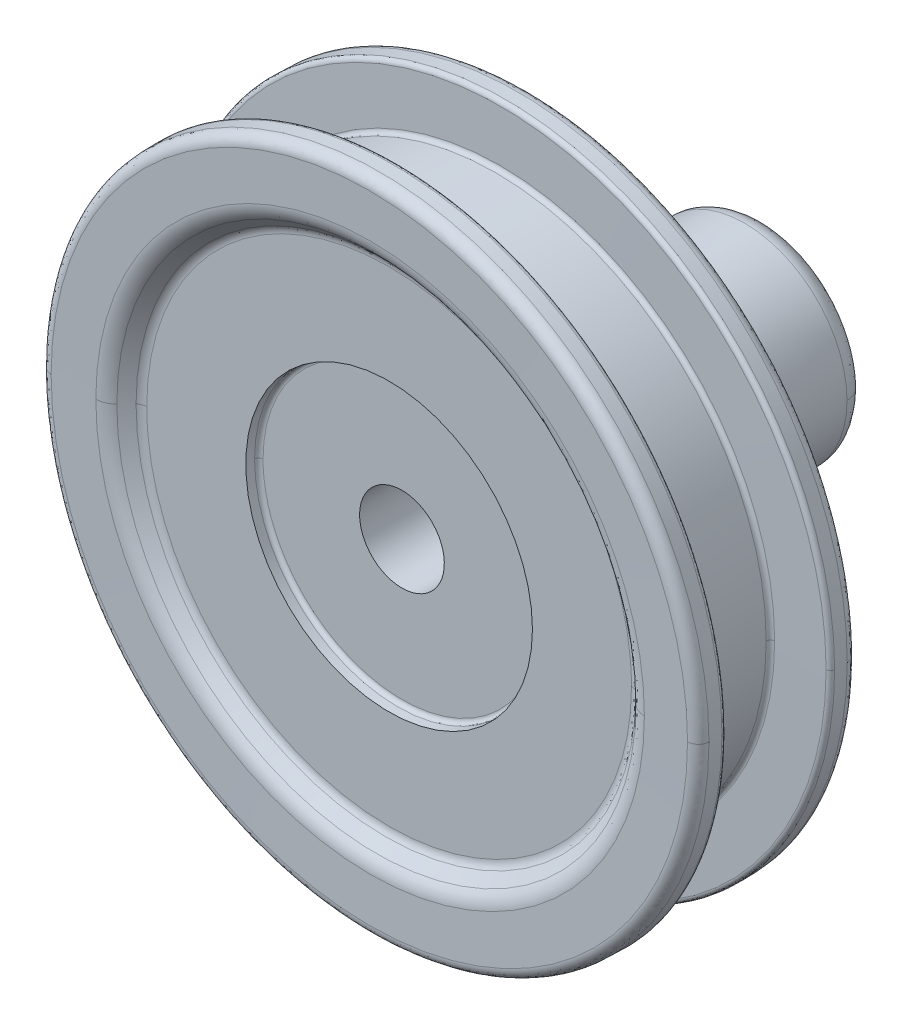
ISO-10303-21;
HEADER;
FILE_DESCRIPTION(('STEP AP214'),'2;1');
FILE_NAME('part.step','',(''),(''),'','','');
FILE_SCHEMA(('AUTOMOTIVE_DESIGN { 1 0 10303 214 1 1 1 1 }'));
ENDSEC;
DATA;
#1=APPLICATION_CONTEXT('core data for automotive mechanical design processes');
#2=APPLICATION_PROTOCOL_DEFINITION('international standard','automotive_design',2000,#1);
#3=PRODUCT_CONTEXT('',#1,'mechanical');
#4=PRODUCT('Part','Part','',(#3));
#5=PRODUCT_RELATED_PRODUCT_CATEGORY('part','',(#4));
#6=PRODUCT_DEFINITION_FORMATION('','',#4);
#7=PRODUCT_DEFINITION_CONTEXT('part definition',#1,'design');
#8=PRODUCT_DEFINITION('design','',#6,#7);
#9=PRODUCT_DEFINITION_SHAPE('','',#8);
#10=(LENGTH_UNIT() NAMED_UNIT(*) SI_UNIT(.MILLI.,.METRE.));
#11=(NAMED_UNIT(*) PLANE_ANGLE_UNIT() SI_UNIT($,.RADIAN.));
#12=(NAMED_UNIT(*) SI_UNIT($,.STERADIAN.) SOLID_ANGLE_UNIT());
#13=UNCERTAINTY_MEASURE_WITH_UNIT(LENGTH_MEASURE(1.E-05),#10,'distance_accuracy_value','');
#14=(GEOMETRIC_REPRESENTATION_CONTEXT(3) GLOBAL_UNCERTAINTY_ASSIGNED_CONTEXT((#13)) GLOBAL_UNIT_ASSIGNED_CONTEXT((#10,
#11,#12)) REPRESENTATION_CONTEXT('',''));
#15=CARTESIAN_POINT('',(0.,0.,0.));
#16=DIRECTION('',(0.,0.,1.));
#17=DIRECTION('',(1.,0.,0.));
#18=AXIS2_PLACEMENT_3D('',#15,#16,#17);
#19=CARTESIAN_POINT('',(-3.285451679,-3.285451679,2.5));
#20=DIRECTION('',(0.,0.,1.));
#21=DIRECTION('',(1.,0.,0.));
#22=AXIS2_PLACEMENT_3D('',#19,#20,#21);
#23=PLANE('',#22);
#24=CARTESIAN_POINT('',(0.,0.,2.5));
#25=DIRECTION('',(0.,0.,1.));
#26=DIRECTION('',(0.,-1.,0.));
#27=AXIS2_PLACEMENT_3D('',#24,#25,#26);
#28=CIRCLE('',#27,0.99);
#29=CARTESIAN_POINT('',(0.,-0.990000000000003,2.5));
#30=VERTEX_POINT('',#29);
#31=EDGE_CURVE('E21',#30,#30,#28,.T.);
#32=ORIENTED_EDGE('',*,*,#31,.F.);
#33=EDGE_LOOP('',(#32));
#34=FACE_BOUND('',#33,.T.);
#35=CARTESIAN_POINT('',(-3.24649375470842,0.,2.49999999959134));
#36=CARTESIAN_POINT('',(-3.24649375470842,6.49298750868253,2.49999999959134));
#37=CARTESIAN_POINT('',(3.24649375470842,6.49298750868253,2.49999999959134));
#38=CARTESIAN_POINT('',(3.24649375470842,0.,2.49999999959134));
#39=(BOUNDED_CURVE() B_SPLINE_CURVE(3,(#35,#36,#37,#38),.UNSPECIFIED.,.F.,
.F.) B_SPLINE_CURVE_WITH_KNOTS((4,4),(0.,1.),
.UNSPECIFIED.) CURVE() GEOMETRIC_REPRESENTATION_ITEM() RATIONAL_B_SPLINE_CURVE((0.957077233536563,
0.319025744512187,0.319025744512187,0.957077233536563)) REPRESENTATION_ITEM(''));
#40=CARTESIAN_POINT('',(3.246493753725,0.,2.49999999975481));
#41=VERTEX_POINT('',#40);
#42=CARTESIAN_POINT('',(-3.246493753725,0.,2.49999999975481));
#43=VERTEX_POINT('',#42);
#44=EDGE_CURVE('E203',#41,#43,#39,.F.);
#45=ORIENTED_EDGE('',*,*,#44,.T.);
#46=CARTESIAN_POINT('',(3.24649375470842,0.,2.49999999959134));
#47=CARTESIAN_POINT('',(3.24649375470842,-6.49298750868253,2.49999999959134));
#48=CARTESIAN_POINT('',(-3.24649375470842,-6.49298750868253,2.49999999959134));
#49=CARTESIAN_POINT('',(-3.24649375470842,0.,2.49999999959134));
#50=(BOUNDED_CURVE() B_SPLINE_CURVE(3,(#46,#47,#48,#49),.UNSPECIFIED.,.F.,
.F.) B_SPLINE_CURVE_WITH_KNOTS((4,4),(0.,1.),
.UNSPECIFIED.) CURVE() GEOMETRIC_REPRESENTATION_ITEM() RATIONAL_B_SPLINE_CURVE((0.957077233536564,
0.319025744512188,0.319025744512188,0.957077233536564)) REPRESENTATION_ITEM(''));
#51=EDGE_CURVE('E199',#43,#41,#50,.F.);
#52=ORIENTED_EDGE('',*,*,#51,.T.);
#53=EDGE_LOOP('',(#45,#52));
#54=FACE_BOUND('',#53,.T.);
#55=ADVANCED_FACE('F16',(#34,#54),#23,.T.);
#56=CARTESIAN_POINT('',(-3.34615325,0.,2.608245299));
#57=CARTESIAN_POINT('',(-3.34615325,-6.692306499,2.608245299));
#58=CARTESIAN_POINT('',(3.34615325,-6.692306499,2.608245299));
#59=CARTESIAN_POINT('',(3.34615325,0.,2.608245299));
#60=CARTESIAN_POINT('',(-3.351713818,0.,2.541035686));
#61=CARTESIAN_POINT('',(-3.351713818,-6.703427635,2.541035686));
#62=CARTESIAN_POINT('',(3.351713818,-6.703427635,2.541035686));
#63=CARTESIAN_POINT('',(3.351713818,0.,2.541035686));
#64=CARTESIAN_POINT('',(-3.303612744,0.,2.493766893));
#65=CARTESIAN_POINT('',(-3.303612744,-6.607225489,2.493766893));
#66=CARTESIAN_POINT('',(3.303612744,-6.607225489,2.493766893));
#67=CARTESIAN_POINT('',(3.303612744,0.,2.493766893));
#68=CARTESIAN_POINT('',(-3.236510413,0.,2.500499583));
#69=CARTESIAN_POINT('',(-3.236510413,-6.473020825,2.500499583));
#70=CARTESIAN_POINT('',(3.236510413,-6.473020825,2.500499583));
#71=CARTESIAN_POINT('',(3.236510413,0.,2.500499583));
#72=(BOUNDED_SURFACE() B_SPLINE_SURFACE(3,3,((#56,#57,#58,#59),(#60,#61,#62,#63),(#64,#65,#66,
#67),(#68,#69,#70,#71)),.UNSPECIFIED.,.F.,.F.,.F.) B_SPLINE_SURFACE_WITH_KNOTS((4,4),(4,4),(0.,
1.),(0.,1.),.UNSPECIFIED.) GEOMETRIC_REPRESENTATION_ITEM() RATIONAL_B_SPLINE_SURFACE(((1.,
0.333333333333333,0.333333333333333,1.),(0.759808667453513,0.253269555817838,0.253269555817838,
0.759808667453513),(0.759808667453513,0.253269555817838,0.253269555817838,0.759808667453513),
(1.,0.333333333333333,0.333333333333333,1.))) REPRESENTATION_ITEM('') SURFACE());
#73=CARTESIAN_POINT('',(-3.34615325,0.,2.608245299));
#74=CARTESIAN_POINT('',(-3.351713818,0.,2.541035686));
#75=CARTESIAN_POINT('',(-3.303612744,0.,2.493766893));
#76=CARTESIAN_POINT('',(-3.236510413,0.,2.500499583));
#77=(BOUNDED_CURVE() B_SPLINE_CURVE(3,(#73,#74,#75,#76),.UNSPECIFIED.,.F.,
.F.) B_SPLINE_CURVE_WITH_KNOTS((4,4),(0.,1.),
.UNSPECIFIED.) CURVE() GEOMETRIC_REPRESENTATION_ITEM() RATIONAL_B_SPLINE_CURVE((1.,
0.759808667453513,0.759808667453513,1.)) REPRESENTATION_ITEM(''));
#78=CARTESIAN_POINT('',(-3.34647852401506,-1.02956132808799E-09,2.59825475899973));
#79=VERTEX_POINT('',#78);
#80=EDGE_CURVE('E209',#43,#79,#77,.F.);
#81=CARTESIAN_POINT('',(0.,0.,2.598254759));
#82=DIRECTION('',(0.,0.,1.));
#83=DIRECTION('',(1.,0.,0.));
#84=AXIS2_PLACEMENT_3D('',#81,#82,#83);
#85=CIRCLE('',#84,3.346478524);
#86=CARTESIAN_POINT('',(3.34647852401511,0.,2.59825475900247));
#87=VERTEX_POINT('',#86);
#88=EDGE_CURVE('E224',#87,#79,#85,.F.);
#89=CARTESIAN_POINT('',(3.34615325,0.,2.608245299));
#90=CARTESIAN_POINT('',(3.351713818,0.,2.541035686));
#91=CARTESIAN_POINT('',(3.303612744,0.,2.493766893));
#92=CARTESIAN_POINT('',(3.236510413,0.,2.500499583));
#93=(BOUNDED_CURVE() B_SPLINE_CURVE(3,(#89,#90,#91,#92),.UNSPECIFIED.,.F.,
.F.) B_SPLINE_CURVE_WITH_KNOTS((4,4),(0.,1.),
.UNSPECIFIED.) CURVE() GEOMETRIC_REPRESENTATION_ITEM() RATIONAL_B_SPLINE_CURVE((1.,
0.759808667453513,0.759808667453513,1.)) REPRESENTATION_ITEM(''));
#94=EDGE_CURVE('E210',#87,#41,#93,.T.);
#95=ORIENTED_EDGE('',*,*,#80,.T.);
#96=ORIENTED_EDGE('',*,*,#88,.F.);
#97=ORIENTED_EDGE('',*,*,#94,.T.);
#98=ORIENTED_EDGE('',*,*,#51,.F.);
#99=EDGE_LOOP('',(#95,#96,#97,#98));
#100=FACE_BOUND('',#99,.T.);
#101=ADVANCED_FACE('F215',(#100),#72,.F.);
#102=CARTESIAN_POINT('',(3.34615325,0.,2.608245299));
#103=CARTESIAN_POINT('',(3.34615325,6.692306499,2.608245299));
#104=CARTESIAN_POINT('',(-3.34615325,6.692306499,2.608245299));
#105=CARTESIAN_POINT('',(-3.34615325,0.,2.608245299));
#106=CARTESIAN_POINT('',(3.351713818,0.,2.541035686));
#107=CARTESIAN_POINT('',(3.351713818,6.703427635,2.541035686));
#108=CARTESIAN_POINT('',(-3.351713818,6.703427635,2.541035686));
#109=CARTESIAN_POINT('',(-3.351713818,0.,2.541035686));
#110=CARTESIAN_POINT('',(3.303612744,0.,2.493766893));
#111=CARTESIAN_POINT('',(3.303612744,6.607225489,2.493766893));
#112=CARTESIAN_POINT('',(-3.303612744,6.607225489,2.493766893));
#113=CARTESIAN_POINT('',(-3.303612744,0.,2.493766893));
#114=CARTESIAN_POINT('',(3.236510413,0.,2.500499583));
#115=CARTESIAN_POINT('',(3.236510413,6.473020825,2.500499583));
#116=CARTESIAN_POINT('',(-3.236510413,6.473020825,2.500499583));
#117=CARTESIAN_POINT('',(-3.236510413,0.,2.500499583));
#118=(BOUNDED_SURFACE() B_SPLINE_SURFACE(3,3,((#102,#103,#104,#105),(#106,#107,#108,#109),(#110,
#111,#112,#113),(#114,#115,#116,#117)),.UNSPECIFIED.,.F.,.F.,
.F.) B_SPLINE_SURFACE_WITH_KNOTS((4,4),(4,4),(0.,1.),(0.,1.),
.UNSPECIFIED.) GEOMETRIC_REPRESENTATION_ITEM() RATIONAL_B_SPLINE_SURFACE(((1.,0.333333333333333,
0.333333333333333,1.),(0.759808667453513,0.253269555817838,0.253269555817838,0.759808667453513),
(0.759808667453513,0.253269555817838,0.253269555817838,0.759808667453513),(1.,0.333333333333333,
0.333333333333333,1.))) REPRESENTATION_ITEM('') SURFACE());
#119=CARTESIAN_POINT('',(0.,0.,2.598254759));
#120=DIRECTION('',(0.,0.,1.));
#121=DIRECTION('',(1.,0.,0.));
#122=AXIS2_PLACEMENT_3D('',#119,#120,#121);
#123=CIRCLE('',#122,3.346478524);
#124=EDGE_CURVE('E221',#79,#87,#123,.F.);
#125=ORIENTED_EDGE('',*,*,#44,.F.);
#126=ORIENTED_EDGE('',*,*,#94,.F.);
#127=ORIENTED_EDGE('',*,*,#124,.F.);
#128=ORIENTED_EDGE('',*,*,#80,.F.);
#129=EDGE_LOOP('',(#125,#126,#127,#128));
#130=FACE_BOUND('',#129,.T.);
#131=ADVANCED_FACE('F219',(#130),#118,.F.);
#132=CARTESIAN_POINT('',(0.,0.,-5.));
#133=DIRECTION('',(0.,0.,1.));
#134=DIRECTION('',(0.,-1.,0.));
#135=AXIS2_PLACEMENT_3D('',#132,#133,#134);
#136=CYLINDRICAL_SURFACE('',#135,0.99);
#137=CARTESIAN_POINT('',(0.,0.,-5.));
#138=DIRECTION('',(0.,0.,1.));
#139=DIRECTION('',(0.,-1.,0.));
#140=AXIS2_PLACEMENT_3D('',#137,#138,#139);
#141=CIRCLE('',#140,0.99);
#142=CARTESIAN_POINT('',(0.,-0.99,-5.));
#143=VERTEX_POINT('',#142);
#144=EDGE_CURVE('E432',#143,#143,#141,.F.);
#145=ORIENTED_EDGE('',*,*,#144,.T.);
#146=EDGE_LOOP('',(#145));
#147=FACE_BOUND('',#146,.T.);
#148=ORIENTED_EDGE('',*,*,#31,.T.);
#149=EDGE_LOOP('',(#148));
#150=FACE_BOUND('',#149,.T.);
#151=ADVANCED_FACE('F251',(#147,#150),#136,.F.);
#152=CARTESIAN_POINT('',(0.,0.,2.598254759));
#153=DIRECTION('',(0.,0.,1.));
#154=DIRECTION('',(1.,0.,0.));
#155=AXIS2_PLACEMENT_3D('',#152,#153,#154);
#156=CONICAL_SURFACE('',#155,3.346478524,0.0174532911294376);
#157=ORIENTED_EDGE('',*,*,#88,.T.);
#158=ORIENTED_EDGE('',*,*,#124,.T.);
#159=EDGE_LOOP('',(#157,#158));
#160=FACE_BOUND('',#159,.T.);
#161=CARTESIAN_POINT('',(0.,0.,2.79999999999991));
#162=DIRECTION('',(0.,0.,1.));
#163=DIRECTION('',(1.,0.,0.));
#164=AXIS2_PLACEMENT_3D('',#161,#162,#163);
#165=CIRCLE('',#164,3.35);
#166=CARTESIAN_POINT('',(3.35,0.,2.79999999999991));
#167=VERTEX_POINT('',#166);
#168=EDGE_CURVE('E430',#167,#167,#165,.T.);
#169=ORIENTED_EDGE('',*,*,#168,.T.);
#170=EDGE_LOOP('',(#169));
#171=FACE_BOUND('',#170,.T.);
#172=ADVANCED_FACE('F462',(#160,#171),#156,.F.);
#173=CARTESIAN_POINT('',(1.00188,-1.00188,-5.));
#174=DIRECTION('',(0.,0.,-1.));
#175=DIRECTION('',(-1.,0.,0.));
#176=AXIS2_PLACEMENT_3D('',#173,#174,#175);
#177=PLANE('',#176);
#178=CARTESIAN_POINT('',(0.,0.,-5.));
#179=DIRECTION('',(0.,0.,-1.));
#180=DIRECTION('',(0.,1.,0.));
#181=AXIS2_PLACEMENT_3D('',#178,#179,#180);
#182=CIRCLE('',#181,0.6);
#183=CARTESIAN_POINT('',(0.,0.6,-5.));
#184=VERTEX_POINT('',#183);
#185=EDGE_CURVE('E421',#184,#184,#182,.F.);
#186=ORIENTED_EDGE('',*,*,#185,.F.);
#187=EDGE_LOOP('',(#186));
#188=FACE_BOUND('',#187,.T.);
#189=ORIENTED_EDGE('',*,*,#144,.F.);
#190=EDGE_LOOP('',(#189));
#191=FACE_BOUND('',#190,.T.);
#192=ADVANCED_FACE('F279',(#188,#191),#177,.F.);
#193=CARTESIAN_POINT('',(5.733056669,-5.733056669,2.8));
#194=DIRECTION('',(0.,0.,-1.));
#195=DIRECTION('',(-1.,0.,0.));
#196=AXIS2_PLACEMENT_3D('',#193,#194,#195);
#197=PLANE('',#196);
#198=ORIENTED_EDGE('',*,*,#168,.F.);
#199=EDGE_LOOP('',(#198));
#200=FACE_BOUND('',#199,.T.);
#201=CARTESIAN_POINT('',(-5.66507575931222,0.,2.80000000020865));
#202=CARTESIAN_POINT('',(-5.66507575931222,11.3301515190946,2.80000000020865));
#203=CARTESIAN_POINT('',(5.66507575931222,11.3301515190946,2.80000000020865));
#204=CARTESIAN_POINT('',(5.66507575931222,0.,2.80000000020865));
#205=(BOUNDED_CURVE() B_SPLINE_CURVE(3,(#201,#202,#203,#204),.UNSPECIFIED.,.F.,
.F.) B_SPLINE_CURVE_WITH_KNOTS((4,4),(0.,1.),
.UNSPECIFIED.) CURVE() GEOMETRIC_REPRESENTATION_ITEM() RATIONAL_B_SPLINE_CURVE((0.977742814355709,
0.325914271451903,0.325914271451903,0.977742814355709)) REPRESENTATION_ITEM(''));
#206=CARTESIAN_POINT('',(5.66507575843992,0.,2.80000000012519));
#207=VERTEX_POINT('',#206);
#208=CARTESIAN_POINT('',(-5.66507575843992,0.,2.80000000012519));
#209=VERTEX_POINT('',#208);
#210=EDGE_CURVE('E301',#207,#209,#205,.F.);
#211=ORIENTED_EDGE('',*,*,#210,.T.);
#212=CARTESIAN_POINT('',(5.66507575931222,0.,2.80000000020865));
#213=CARTESIAN_POINT('',(5.66507575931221,-11.3301515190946,2.80000000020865));
#214=CARTESIAN_POINT('',(-5.66507575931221,-11.3301515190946,2.80000000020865));
#215=CARTESIAN_POINT('',(-5.66507575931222,0.,2.80000000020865));
#216=(BOUNDED_CURVE() B_SPLINE_CURVE(3,(#212,#213,#214,#215),.UNSPECIFIED.,.F.,
.F.) B_SPLINE_CURVE_WITH_KNOTS((4,4),(0.,1.),
.UNSPECIFIED.) CURVE() GEOMETRIC_REPRESENTATION_ITEM() RATIONAL_B_SPLINE_CURVE((0.977742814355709,
0.325914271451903,0.325914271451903,0.977742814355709)) REPRESENTATION_ITEM(''));
#217=EDGE_CURVE('E429',#209,#207,#216,.F.);
#218=ORIENTED_EDGE('',*,*,#217,.T.);
#219=EDGE_LOOP('',(#211,#218));
#220=FACE_BOUND('',#219,.T.);
#221=ADVANCED_FACE('F307',(#200,#220),#197,.F.);
#222=CARTESIAN_POINT('',(5.640117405,0.,2.801248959));
#223=CARTESIAN_POINT('',(5.640117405,-11.280234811,2.801248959));
#224=CARTESIAN_POINT('',(-5.640117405,-11.280234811,2.801248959));
#225=CARTESIAN_POINT('',(-5.640117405,0.,2.801248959));
#226=CARTESIAN_POINT('',(5.725313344,0.,2.792700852));
#227=CARTESIAN_POINT('',(5.725313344,-11.450626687,2.792700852));
#228=CARTESIAN_POINT('',(-5.725313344,-11.450626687,2.792700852));
#229=CARTESIAN_POINT('',(-5.725313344,0.,2.792700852));
#230=CARTESIAN_POINT('',(5.804419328,0.,2.825467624));
#231=CARTESIAN_POINT('',(5.804419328,-11.608838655,2.825467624));
#232=CARTESIAN_POINT('',(-5.804419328,-11.608838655,2.825467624));
#233=CARTESIAN_POINT('',(-5.804419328,0.,2.825467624));
#234=CARTESIAN_POINT('',(5.858617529,0.,2.891754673));
#235=CARTESIAN_POINT('',(5.858617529,-11.717235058,2.891754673));
#236=CARTESIAN_POINT('',(-5.858617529,-11.717235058,2.891754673));
#237=CARTESIAN_POINT('',(-5.858617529,0.,2.891754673));
#238=(BOUNDED_SURFACE() B_SPLINE_SURFACE(3,3,((#222,#223,#224,#225),(#226,#227,#228,#229),(#230,
#231,#232,#233),(#234,#235,#236,#237)),.UNSPECIFIED.,.F.,.F.,
.F.) B_SPLINE_SURFACE_WITH_KNOTS((4,4),(4,4),(0.,1.),(0.,1.),
.UNSPECIFIED.) GEOMETRIC_REPRESENTATION_ITEM() RATIONAL_B_SPLINE_SURFACE(((1.,0.333333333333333,
0.333333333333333,1.),(0.920706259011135,0.306902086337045,0.306902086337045,0.920706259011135),
(0.920706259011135,0.306902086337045,0.306902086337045,0.920706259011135),(1.,0.333333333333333,
0.333333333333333,1.))) REPRESENTATION_ITEM('') SURFACE());
#239=CARTESIAN_POINT('',(5.640117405,0.,2.801248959));
#240=CARTESIAN_POINT('',(5.725313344,0.,2.792700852));
#241=CARTESIAN_POINT('',(5.804419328,0.,2.825467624));
#242=CARTESIAN_POINT('',(5.858617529,0.,2.891754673));
#243=(BOUNDED_CURVE() B_SPLINE_CURVE(3,(#239,#240,#241,#242),.UNSPECIFIED.,.F.,
.F.) B_SPLINE_CURVE_WITH_KNOTS((4,4),(0.,1.),
.UNSPECIFIED.) CURVE() GEOMETRIC_REPRESENTATION_ITEM() RATIONAL_B_SPLINE_CURVE((1.,
0.920706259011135,0.920706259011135,1.)) REPRESENTATION_ITEM(''));
#244=CARTESIAN_POINT('',(5.841852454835,-1.31140282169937E-10,2.87322330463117));
#245=VERTEX_POINT('',#244);
#246=EDGE_CURVE('E1003',#245,#207,#243,.F.);
#247=CARTESIAN_POINT('',(-5.640117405,0.,2.801248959));
#248=CARTESIAN_POINT('',(-5.725313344,0.,2.792700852));
#249=CARTESIAN_POINT('',(-5.804419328,0.,2.825467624));
#250=CARTESIAN_POINT('',(-5.858617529,0.,2.891754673));
#251=(BOUNDED_CURVE() B_SPLINE_CURVE(3,(#247,#248,#249,#250),.UNSPECIFIED.,.F.,
.F.) B_SPLINE_CURVE_WITH_KNOTS((4,4),(0.,1.),
.UNSPECIFIED.) CURVE() GEOMETRIC_REPRESENTATION_ITEM() RATIONAL_B_SPLINE_CURVE((1.,
0.920706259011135,0.920706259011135,1.)) REPRESENTATION_ITEM(''));
#252=CARTESIAN_POINT('',(-5.84185245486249,-8.98637975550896E-10,2.87322330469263));
#253=VERTEX_POINT('',#252);
#254=EDGE_CURVE('E1027',#209,#253,#251,.T.);
#255=CARTESIAN_POINT('',(0.,0.,2.87322330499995));
#256=DIRECTION('',(0.,0.,1.));
#257=DIRECTION('',(1.,0.,0.));
#258=AXIS2_PLACEMENT_3D('',#255,#256,#257);
#259=CIRCLE('',#258,5.841852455);
#260=EDGE_CURVE('E994',#245,#253,#259,.F.);
#261=ORIENTED_EDGE('',*,*,#246,.T.);
#262=ORIENTED_EDGE('',*,*,#217,.F.);
#263=ORIENTED_EDGE('',*,*,#254,.T.);
#264=ORIENTED_EDGE('',*,*,#260,.F.);
#265=EDGE_LOOP('',(#261,#262,#263,#264));
#266=FACE_BOUND('',#265,.T.);
#267=ADVANCED_FACE('F315',(#266),#238,.F.);
#268=CARTESIAN_POINT('',(0.,0.,-5.));
#269=DIRECTION('',(0.,0.,-1.));
#270=DIRECTION('',(0.,1.,0.));
#271=AXIS2_PLACEMENT_3D('',#268,#269,#270);
#272=CONICAL_SURFACE('',#271,0.6,0.0523598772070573);
#273=ORIENTED_EDGE('',*,*,#185,.T.);
#274=EDGE_LOOP('',(#273));
#275=FACE_BOUND('',#274,.T.);
#276=CARTESIAN_POINT('',(0.,0.,-5.76308398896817));
#277=DIRECTION('',(0.,0.,1.));
#278=DIRECTION('',(0.,-1.,0.));
#279=AXIS2_PLACEMENT_3D('',#276,#277,#278);
#280=CIRCLE('',#279,0.639991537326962);
#281=CARTESIAN_POINT('',(0.63999153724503,-6.56322292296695E-11,-5.76308398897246));
#282=VERTEX_POINT('',#281);
#283=CARTESIAN_POINT('',(-0.639991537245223,0.,-5.76308398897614));
#284=VERTEX_POINT('',#283);
#285=EDGE_CURVE('E1008',#282,#284,#280,.T.);
#286=ORIENTED_EDGE('',*,*,#285,.F.);
#287=CARTESIAN_POINT('',(0.,0.,-5.76308398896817));
#288=DIRECTION('',(0.,0.,1.));
#289=DIRECTION('',(0.,-1.,0.));
#290=AXIS2_PLACEMENT_3D('',#287,#288,#289);
#291=CIRCLE('',#290,0.639991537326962);
#292=EDGE_CURVE('E1002',#284,#282,#291,.T.);
#293=ORIENTED_EDGE('',*,*,#292,.F.);
#294=EDGE_LOOP('',(#286,#293));
#295=FACE_BOUND('',#294,.T.);
#296=ADVANCED_FACE('F459',(#275,#295),#272,.F.);
#297=CARTESIAN_POINT('',(-5.640117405,0.,2.801248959));
#298=CARTESIAN_POINT('',(-5.640117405,11.280234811,2.801248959));
#299=CARTESIAN_POINT('',(5.640117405,11.280234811,2.801248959));
#300=CARTESIAN_POINT('',(5.640117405,0.,2.801248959));
#301=CARTESIAN_POINT('',(-5.725313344,0.,2.792700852));
#302=CARTESIAN_POINT('',(-5.725313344,11.450626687,2.792700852));
#303=CARTESIAN_POINT('',(5.725313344,11.450626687,2.792700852));
#304=CARTESIAN_POINT('',(5.725313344,0.,2.792700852));
#305=CARTESIAN_POINT('',(-5.804419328,0.,2.825467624));
#306=CARTESIAN_POINT('',(-5.804419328,11.608838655,2.825467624));
#307=CARTESIAN_POINT('',(5.804419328,11.608838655,2.825467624));
#308=CARTESIAN_POINT('',(5.804419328,0.,2.825467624));
#309=CARTESIAN_POINT('',(-5.858617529,0.,2.891754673));
#310=CARTESIAN_POINT('',(-5.858617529,11.717235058,2.891754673));
#311=CARTESIAN_POINT('',(5.858617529,11.717235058,2.891754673));
#312=CARTESIAN_POINT('',(5.858617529,0.,2.891754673));
#313=(BOUNDED_SURFACE() B_SPLINE_SURFACE(3,3,((#297,#298,#299,#300),(#301,#302,#303,#304),(#305,
#306,#307,#308),(#309,#310,#311,#312)),.UNSPECIFIED.,.F.,.F.,
.F.) B_SPLINE_SURFACE_WITH_KNOTS((4,4),(4,4),(0.,1.),(0.,1.),
.UNSPECIFIED.) GEOMETRIC_REPRESENTATION_ITEM() RATIONAL_B_SPLINE_SURFACE(((1.,0.333333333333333,
0.333333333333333,1.),(0.920706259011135,0.306902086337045,0.306902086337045,0.920706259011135),
(0.920706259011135,0.306902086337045,0.306902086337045,0.920706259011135),(1.,0.333333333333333,
0.333333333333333,1.))) REPRESENTATION_ITEM('') SURFACE());
#314=CARTESIAN_POINT('',(0.,0.,2.87322330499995));
#315=DIRECTION('',(0.,0.,1.));
#316=DIRECTION('',(1.,0.,0.));
#317=AXIS2_PLACEMENT_3D('',#314,#315,#316);
#318=CIRCLE('',#317,5.841852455);
#319=EDGE_CURVE('E941',#253,#245,#318,.F.);
#320=ORIENTED_EDGE('',*,*,#319,.F.);
#321=ORIENTED_EDGE('',*,*,#254,.F.);
#322=ORIENTED_EDGE('',*,*,#210,.F.);
#323=ORIENTED_EDGE('',*,*,#246,.F.);
#324=EDGE_LOOP('',(#320,#321,#322,#323));
#325=FACE_BOUND('',#324,.T.);
#326=ADVANCED_FACE('F978',(#325),#313,.F.);
#327=CARTESIAN_POINT('',(0.639932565,0.,-5.738094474));
#328=CARTESIAN_POINT('',(0.639932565,-1.27986513,-5.738094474));
#329=CARTESIAN_POINT('',(-0.639932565,-1.27986513,-5.738094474));
#330=CARTESIAN_POINT('',(-0.639932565,0.,-5.738094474));
#331=CARTESIAN_POINT('',(0.632112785,0.,-5.902113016));
#332=CARTESIAN_POINT('',(0.632112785,-1.26422557,-5.902113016));
#333=CARTESIAN_POINT('',(-0.632112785,-1.26422557,-5.902113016));
#334=CARTESIAN_POINT('',(-0.632112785,0.,-5.902113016));
#335=CARTESIAN_POINT('',(0.751222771,0.,-6.015144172));
#336=CARTESIAN_POINT('',(0.751222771,-1.502445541,-6.015144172));
#337=CARTESIAN_POINT('',(-0.751222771,-1.502445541,-6.015144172));
#338=CARTESIAN_POINT('',(-0.751222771,0.,-6.015144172));
#339=CARTESIAN_POINT('',(0.914607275,0.,-5.998751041));
#340=CARTESIAN_POINT('',(0.914607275,-1.82921455,-5.998751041));
#341=CARTESIAN_POINT('',(-0.914607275,-1.82921455,-5.998751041));
#342=CARTESIAN_POINT('',(-0.914607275,0.,-5.998751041));
#343=(BOUNDED_SURFACE() B_SPLINE_SURFACE(3,3,((#327,#328,#329,#330),(#331,#332,#333,#334),(#335,
#336,#337,#338),(#339,#340,#341,#342)),.UNSPECIFIED.,.F.,.F.,
.F.) B_SPLINE_SURFACE_WITH_KNOTS((4,4),(4,4),(0.,1.),(0.,1.),
.UNSPECIFIED.) GEOMETRIC_REPRESENTATION_ITEM() RATIONAL_B_SPLINE_SURFACE(((1.,0.333333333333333,
0.333333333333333,1.),(0.76868648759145,0.25622882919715,0.25622882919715,0.76868648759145),
(0.76868648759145,0.25622882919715,0.25622882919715,0.76868648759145),(1.,0.333333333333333,
0.333333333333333,1.))) REPRESENTATION_ITEM('') SURFACE());
#344=CARTESIAN_POINT('',(-0.639932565,0.,-5.738094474));
#345=CARTESIAN_POINT('',(-0.632112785,0.,-5.902113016));
#346=CARTESIAN_POINT('',(-0.751222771,0.,-6.015144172));
#347=CARTESIAN_POINT('',(-0.914607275,0.,-5.998751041));
#348=(BOUNDED_CURVE() B_SPLINE_CURVE(3,(#344,#345,#346,#347),.UNSPECIFIED.,.F.,
.F.) B_SPLINE_CURVE_WITH_KNOTS((4,4),(0.,1.),
.UNSPECIFIED.) CURVE() GEOMETRIC_REPRESENTATION_ITEM() RATIONAL_B_SPLINE_CURVE((1.,
0.76868648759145,0.76868648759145,1.)) REPRESENTATION_ITEM(''));
#349=CARTESIAN_POINT('',(-0.889648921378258,0.,-5.99999999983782));
#350=VERTEX_POINT('',#349);
#351=EDGE_CURVE('E944',#284,#350,#348,.T.);
#352=CARTESIAN_POINT('',(0.639932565,0.,-5.738094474));
#353=CARTESIAN_POINT('',(0.632112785,0.,-5.902113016));
#354=CARTESIAN_POINT('',(0.751222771,0.,-6.015144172));
#355=CARTESIAN_POINT('',(0.914607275,0.,-5.998751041));
#356=(BOUNDED_CURVE() B_SPLINE_CURVE(3,(#352,#353,#354,#355),.UNSPECIFIED.,.F.,
.F.) B_SPLINE_CURVE_WITH_KNOTS((4,4),(0.,1.),
.UNSPECIFIED.) CURVE() GEOMETRIC_REPRESENTATION_ITEM() RATIONAL_B_SPLINE_CURVE((1.,
0.76868648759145,0.76868648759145,1.)) REPRESENTATION_ITEM(''));
#357=CARTESIAN_POINT('',(0.889648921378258,0.,-5.99999999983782));
#358=VERTEX_POINT('',#357);
#359=EDGE_CURVE('E1005',#358,#282,#356,.F.);
#360=CARTESIAN_POINT('',(0.8896489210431,0.,-5.9999999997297));
#361=CARTESIAN_POINT('',(0.8896489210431,-1.77929784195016,-5.9999999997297));
#362=CARTESIAN_POINT('',(-0.8896489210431,-1.77929784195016,-5.9999999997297));
#363=CARTESIAN_POINT('',(-0.8896489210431,0.,-5.9999999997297));
#364=(BOUNDED_CURVE() B_SPLINE_CURVE(3,(#360,#361,#362,#363),.UNSPECIFIED.,.F.,
.F.) B_SPLINE_CURVE_WITH_KNOTS((4,4),(0.,1.),
.UNSPECIFIED.) CURVE() GEOMETRIC_REPRESENTATION_ITEM() RATIONAL_B_SPLINE_CURVE((0.958070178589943,
0.319356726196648,0.319356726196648,0.958070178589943)) REPRESENTATION_ITEM(''));
#365=EDGE_CURVE('E332',#350,#358,#364,.F.);
#366=ORIENTED_EDGE('',*,*,#351,.F.);
#367=ORIENTED_EDGE('',*,*,#292,.T.);
#368=ORIENTED_EDGE('',*,*,#359,.F.);
#369=ORIENTED_EDGE('',*,*,#365,.F.);
#370=EDGE_LOOP('',(#366,#367,#368,#369));
#371=FACE_BOUND('',#370,.T.);
#372=ADVANCED_FACE('F967',(#371),#343,.T.);
#373=CARTESIAN_POINT('',(-0.639932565,0.,-5.738094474));
#374=CARTESIAN_POINT('',(-0.639932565,1.27986513,-5.738094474));
#375=CARTESIAN_POINT('',(0.639932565,1.27986513,-5.738094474));
#376=CARTESIAN_POINT('',(0.639932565,0.,-5.738094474));
#377=CARTESIAN_POINT('',(-0.632112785,0.,-5.902113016));
#378=CARTESIAN_POINT('',(-0.632112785,1.26422557,-5.902113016));
#379=CARTESIAN_POINT('',(0.632112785,1.26422557,-5.902113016));
#380=CARTESIAN_POINT('',(0.632112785,0.,-5.902113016));
#381=CARTESIAN_POINT('',(-0.751222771,0.,-6.015144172));
#382=CARTESIAN_POINT('',(-0.751222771,1.502445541,-6.015144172));
#383=CARTESIAN_POINT('',(0.751222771,1.502445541,-6.015144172));
#384=CARTESIAN_POINT('',(0.751222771,0.,-6.015144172));
#385=CARTESIAN_POINT('',(-0.914607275,0.,-5.998751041));
#386=CARTESIAN_POINT('',(-0.914607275,1.82921455,-5.998751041));
#387=CARTESIAN_POINT('',(0.914607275,1.82921455,-5.998751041));
#388=CARTESIAN_POINT('',(0.914607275,0.,-5.998751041));
#389=(BOUNDED_SURFACE() B_SPLINE_SURFACE(3,3,((#373,#374,#375,#376),(#377,#378,#379,#380),(#381,
#382,#383,#384),(#385,#386,#387,#388)),.UNSPECIFIED.,.F.,.F.,
.F.) B_SPLINE_SURFACE_WITH_KNOTS((4,4),(4,4),(0.,1.),(0.,1.),
.UNSPECIFIED.) GEOMETRIC_REPRESENTATION_ITEM() RATIONAL_B_SPLINE_SURFACE(((1.,0.333333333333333,
0.333333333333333,1.),(0.76868648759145,0.25622882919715,0.25622882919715,0.76868648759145),
(0.76868648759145,0.25622882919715,0.25622882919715,0.76868648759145),(1.,0.333333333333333,
0.333333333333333,1.))) REPRESENTATION_ITEM('') SURFACE());
#390=CARTESIAN_POINT('',(-0.8896489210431,0.,-5.9999999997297));
#391=CARTESIAN_POINT('',(-0.8896489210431,1.77929784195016,-5.9999999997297));
#392=CARTESIAN_POINT('',(0.8896489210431,1.77929784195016,-5.9999999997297));
#393=CARTESIAN_POINT('',(0.8896489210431,0.,-5.9999999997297));
#394=(BOUNDED_CURVE() B_SPLINE_CURVE(3,(#390,#391,#392,#393),.UNSPECIFIED.,.F.,
.F.) B_SPLINE_CURVE_WITH_KNOTS((4,4),(0.,1.),
.UNSPECIFIED.) CURVE() GEOMETRIC_REPRESENTATION_ITEM() RATIONAL_B_SPLINE_CURVE((0.958070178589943,
0.319356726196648,0.319356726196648,0.958070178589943)) REPRESENTATION_ITEM(''));
#395=EDGE_CURVE('E343',#358,#350,#394,.F.);
#396=ORIENTED_EDGE('',*,*,#285,.T.);
#397=ORIENTED_EDGE('',*,*,#351,.T.);
#398=ORIENTED_EDGE('',*,*,#395,.F.);
#399=ORIENTED_EDGE('',*,*,#359,.T.);
#400=EDGE_LOOP('',(#396,#397,#398,#399));
#401=FACE_BOUND('',#400,.T.);
#402=ADVANCED_FACE('F954',(#401),#389,.T.);
#403=CARTESIAN_POINT('',(0.,0.,2.873223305));
#404=DIRECTION('',(0.,0.,1.));
#405=DIRECTION('',(1.,0.,0.));
#406=AXIS2_PLACEMENT_3D('',#403,#404,#405);
#407=CONICAL_SURFACE('',#406,5.841852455,0.785398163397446);
#408=ORIENTED_EDGE('',*,*,#260,.T.);
#409=ORIENTED_EDGE('',*,*,#319,.T.);
#410=EDGE_LOOP('',(#408,#409));
#411=FACE_BOUND('',#410,.T.);
#412=CARTESIAN_POINT('',(0.,0.,3.0979991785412));
#413=DIRECTION('',(0.,0.,-1.));
#414=DIRECTION('',(0.,1.,0.));
#415=AXIS2_PLACEMENT_3D('',#412,#413,#414);
#416=CIRCLE('',#415,6.06662832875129);
#417=CARTESIAN_POINT('',(-6.06662832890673,-1.55535783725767E-09,3.09799917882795));
#418=VERTEX_POINT('',#417);
#419=CARTESIAN_POINT('',(6.06662832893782,-5.44744569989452E-10,3.0979991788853));
#420=VERTEX_POINT('',#419);
#421=EDGE_CURVE('E837',#418,#420,#416,.T.);
#422=ORIENTED_EDGE('',*,*,#421,.F.);
#423=CARTESIAN_POINT('',(0.,0.,3.0979991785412));
#424=DIRECTION('',(0.,0.,-1.));
#425=DIRECTION('',(0.,1.,0.));
#426=AXIS2_PLACEMENT_3D('',#423,#424,#425);
#427=CIRCLE('',#426,6.06662832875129);
#428=EDGE_CURVE('E936',#420,#418,#427,.T.);
#429=ORIENTED_EDGE('',*,*,#428,.F.);
#430=EDGE_LOOP('',(#422,#429));
#431=FACE_BOUND('',#430,.T.);
#432=ADVANCED_FACE('F966',(#411,#431),#407,.F.);
#433=CARTESIAN_POINT('',(-6.03309818,0.,3.060936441));
#434=CARTESIAN_POINT('',(-6.03309818,-12.06619636,3.060936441));
#435=CARTESIAN_POINT('',(6.03309818,-12.06619636,3.060936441));
#436=CARTESIAN_POINT('',(6.03309818,0.,3.060936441));
#437=CARTESIAN_POINT('',(-6.139413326,0.,3.190965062));
#438=CARTESIAN_POINT('',(-6.139413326,-12.278826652,3.190965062));
#439=CARTESIAN_POINT('',(6.139413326,-12.278826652,3.190965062));
#440=CARTESIAN_POINT('',(6.139413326,0.,3.190965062));
#441=CARTESIAN_POINT('',(-6.294020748,0.,3.256592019));
#442=CARTESIAN_POINT('',(-6.294020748,-12.588041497,3.256592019));
#443=CARTESIAN_POINT('',(6.294020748,-12.588041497,3.256592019));
#444=CARTESIAN_POINT('',(6.294020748,0.,3.256592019));
#445=CARTESIAN_POINT('',(-6.461408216,0.,3.242743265));
#446=CARTESIAN_POINT('',(-6.461408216,-12.922816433,3.242743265));
#447=CARTESIAN_POINT('',(6.461408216,-12.922816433,3.242743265));
#448=CARTESIAN_POINT('',(6.461408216,0.,3.242743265));
#449=(BOUNDED_SURFACE() B_SPLINE_SURFACE(3,3,((#433,#434,#435,#436),(#437,#438,#439,#440),(#441,
#442,#443,#444),(#445,#446,#447,#448)),.UNSPECIFIED.,.F.,.F.,
.F.) B_SPLINE_SURFACE_WITH_KNOTS((4,4),(4,4),(0.,1.),(0.,1.),
.UNSPECIFIED.) GEOMETRIC_REPRESENTATION_ITEM() RATIONAL_B_SPLINE_SURFACE(((1.,0.333333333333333,
0.333333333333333,1.),(0.923435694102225,0.307811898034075,0.307811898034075,0.923435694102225),
(0.923435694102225,0.307811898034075,0.307811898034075,0.923435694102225),(1.,0.333333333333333,
0.333333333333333,1.))) REPRESENTATION_ITEM('') SURFACE());
#450=CARTESIAN_POINT('',(6.03309818,0.,3.060936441));
#451=CARTESIAN_POINT('',(6.139413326,0.,3.190965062));
#452=CARTESIAN_POINT('',(6.294020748,0.,3.256592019));
#453=CARTESIAN_POINT('',(6.461408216,0.,3.242743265));
#454=(BOUNDED_CURVE() B_SPLINE_CURVE(3,(#450,#451,#452,#453),.UNSPECIFIED.,.F.,
.F.) B_SPLINE_CURVE_WITH_KNOTS((4,4),(0.,1.),
.UNSPECIFIED.) CURVE() GEOMETRIC_REPRESENTATION_ITEM() RATIONAL_B_SPLINE_CURVE((1.,
0.923435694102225,0.923435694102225,1.)) REPRESENTATION_ITEM(''));
#455=CARTESIAN_POINT('',(6.41145551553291,-1.43926963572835E-10,3.24436963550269));
#456=VERTEX_POINT('',#455);
#457=EDGE_CURVE('E832',#420,#456,#454,.T.);
#458=CARTESIAN_POINT('',(-6.03309818,0.,3.060936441));
#459=CARTESIAN_POINT('',(-6.139413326,0.,3.190965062));
#460=CARTESIAN_POINT('',(-6.294020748,0.,3.256592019));
#461=CARTESIAN_POINT('',(-6.461408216,0.,3.242743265));
#462=(BOUNDED_CURVE() B_SPLINE_CURVE(3,(#458,#459,#460,#461),.UNSPECIFIED.,.F.,
.F.) B_SPLINE_CURVE_WITH_KNOTS((4,4),(0.,1.),
.UNSPECIFIED.) CURVE() GEOMETRIC_REPRESENTATION_ITEM() RATIONAL_B_SPLINE_CURVE((1.,
0.923435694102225,0.923435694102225,1.)) REPRESENTATION_ITEM(''));
#463=CARTESIAN_POINT('',(-6.41145551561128,-9.86258631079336E-10,3.24436963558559));
#464=VERTEX_POINT('',#463);
#465=EDGE_CURVE('E843',#464,#418,#462,.F.);
#466=CARTESIAN_POINT('',(0.,0.,3.24436963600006));
#467=DIRECTION('',(0.,0.,1.));
#468=DIRECTION('',(1.,0.,0.));
#469=AXIS2_PLACEMENT_3D('',#466,#467,#468);
#470=CIRCLE('',#469,6.411455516);
#471=EDGE_CURVE('E812',#456,#464,#470,.F.);
#472=ORIENTED_EDGE('',*,*,#457,.F.);
#473=ORIENTED_EDGE('',*,*,#428,.T.);
#474=ORIENTED_EDGE('',*,*,#465,.F.);
#475=ORIENTED_EDGE('',*,*,#471,.F.);
#476=EDGE_LOOP('',(#472,#473,#474,#475));
#477=FACE_BOUND('',#476,.T.);
#478=ADVANCED_FACE('F1146',(#477),#449,.T.);
#479=CARTESIAN_POINT('',(1.916648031,-1.916648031,-6.));
#480=DIRECTION('',(0.,0.,-1.));
#481=DIRECTION('',(-1.,0.,0.));
#482=AXIS2_PLACEMENT_3D('',#479,#480,#481);
#483=PLANE('',#482);
#484=ORIENTED_EDGE('',*,*,#365,.T.);
#485=ORIENTED_EDGE('',*,*,#395,.T.);
#486=EDGE_LOOP('',(#484,#485));
#487=FACE_BOUND('',#486,.T.);
#488=CARTESIAN_POINT('',(1.89392097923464,0.,-6.00000000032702));
#489=CARTESIAN_POINT('',(1.89392097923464,3.78784195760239,-6.00000000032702));
#490=CARTESIAN_POINT('',(-1.89392097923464,3.78784195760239,-6.00000000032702));
#491=CARTESIAN_POINT('',(-1.89392097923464,0.,-6.00000000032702));
#492=(BOUNDED_CURVE() B_SPLINE_CURVE(3,(#488,#489,#490,#491),.UNSPECIFIED.,.F.,
.F.) B_SPLINE_CURVE_WITH_KNOTS((4,4),(0.,1.),
.UNSPECIFIED.) CURVE() GEOMETRIC_REPRESENTATION_ITEM() RATIONAL_B_SPLINE_CURVE((0.957077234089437,
0.319025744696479,0.319025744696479,0.957077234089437)) REPRESENTATION_ITEM(''));
#493=CARTESIAN_POINT('',(1.89392097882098,0.,-6.00000000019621));
#494=VERTEX_POINT('',#493);
#495=CARTESIAN_POINT('',(-1.89392097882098,0.,-6.00000000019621));
#496=VERTEX_POINT('',#495);
#497=EDGE_CURVE('E356',#494,#496,#492,.T.);
#498=ORIENTED_EDGE('',*,*,#497,.F.);
#499=CARTESIAN_POINT('',(-1.89392097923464,0.,-6.00000000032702));
#500=CARTESIAN_POINT('',(-1.89392097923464,-3.78784195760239,-6.00000000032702));
#501=CARTESIAN_POINT('',(1.89392097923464,-3.78784195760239,-6.00000000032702));
#502=CARTESIAN_POINT('',(1.89392097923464,0.,-6.00000000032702));
#503=(BOUNDED_CURVE() B_SPLINE_CURVE(3,(#499,#500,#501,#502),.UNSPECIFIED.,.F.,
.F.) B_SPLINE_CURVE_WITH_KNOTS((4,4),(0.,1.),
.UNSPECIFIED.) CURVE() GEOMETRIC_REPRESENTATION_ITEM() RATIONAL_B_SPLINE_CURVE((0.957077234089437,
0.319025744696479,0.319025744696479,0.957077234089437)) REPRESENTATION_ITEM(''));
#504=EDGE_CURVE('E367',#496,#494,#503,.T.);
#505=ORIENTED_EDGE('',*,*,#504,.F.);
#506=EDGE_LOOP('',(#498,#505));
#507=FACE_BOUND('',#506,.T.);
#508=ADVANCED_FACE('F317',(#487,#507),#483,.T.);
#509=CARTESIAN_POINT('',(6.03309818,0.,3.060936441));
#510=CARTESIAN_POINT('',(6.03309818,12.06619636,3.060936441));
#511=CARTESIAN_POINT('',(-6.03309818,12.06619636,3.060936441));
#512=CARTESIAN_POINT('',(-6.03309818,0.,3.060936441));
#513=CARTESIAN_POINT('',(6.139413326,0.,3.190965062));
#514=CARTESIAN_POINT('',(6.139413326,12.278826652,3.190965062));
#515=CARTESIAN_POINT('',(-6.139413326,12.278826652,3.190965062));
#516=CARTESIAN_POINT('',(-6.139413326,0.,3.190965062));
#517=CARTESIAN_POINT('',(6.294020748,0.,3.256592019));
#518=CARTESIAN_POINT('',(6.294020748,12.588041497,3.256592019));
#519=CARTESIAN_POINT('',(-6.294020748,12.588041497,3.256592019));
#520=CARTESIAN_POINT('',(-6.294020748,0.,3.256592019));
#521=CARTESIAN_POINT('',(6.461408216,0.,3.242743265));
#522=CARTESIAN_POINT('',(6.461408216,12.922816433,3.242743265));
#523=CARTESIAN_POINT('',(-6.461408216,12.922816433,3.242743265));
#524=CARTESIAN_POINT('',(-6.461408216,0.,3.242743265));
#525=(BOUNDED_SURFACE() B_SPLINE_SURFACE(3,3,((#509,#510,#511,#512),(#513,#514,#515,#516),(#517,
#518,#519,#520),(#521,#522,#523,#524)),.UNSPECIFIED.,.F.,.F.,
.F.) B_SPLINE_SURFACE_WITH_KNOTS((4,4),(4,4),(0.,1.),(0.,1.),
.UNSPECIFIED.) GEOMETRIC_REPRESENTATION_ITEM() RATIONAL_B_SPLINE_SURFACE(((1.,0.333333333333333,
0.333333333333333,1.),(0.923435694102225,0.307811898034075,0.307811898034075,0.923435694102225),
(0.923435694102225,0.307811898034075,0.307811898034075,0.923435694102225),(1.,0.333333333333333,
0.333333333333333,1.))) REPRESENTATION_ITEM('') SURFACE());
#526=CARTESIAN_POINT('',(0.,0.,3.24436963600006));
#527=DIRECTION('',(0.,0.,1.));
#528=DIRECTION('',(1.,0.,0.));
#529=AXIS2_PLACEMENT_3D('',#526,#527,#528);
#530=CIRCLE('',#529,6.411455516);
#531=EDGE_CURVE('E766',#464,#456,#530,.F.);
#532=ORIENTED_EDGE('',*,*,#421,.T.);
#533=ORIENTED_EDGE('',*,*,#457,.T.);
#534=ORIENTED_EDGE('',*,*,#531,.F.);
#535=ORIENTED_EDGE('',*,*,#465,.T.);
#536=EDGE_LOOP('',(#532,#533,#534,#535));
#537=FACE_BOUND('',#536,.T.);
#538=ADVANCED_FACE('F1160',(#537),#525,.T.);
#539=CARTESIAN_POINT('',(-6.461408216,0.,-0.442743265));
#540=CARTESIAN_POINT('',(-6.461408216,-12.922816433,-0.442743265));
#541=CARTESIAN_POINT('',(6.461408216,-12.922816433,-0.442743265));
#542=CARTESIAN_POINT('',(6.461408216,0.,-0.442743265));
#543=CARTESIAN_POINT('',(-6.294020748,0.,-0.456592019));
#544=CARTESIAN_POINT('',(-6.294020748,-12.588041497,-0.456592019));
#545=CARTESIAN_POINT('',(6.294020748,-12.588041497,-0.456592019));
#546=CARTESIAN_POINT('',(6.294020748,0.,-0.456592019));
#547=CARTESIAN_POINT('',(-6.139413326,0.,-0.390965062));
#548=CARTESIAN_POINT('',(-6.139413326,-12.278826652,-0.390965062));
#549=CARTESIAN_POINT('',(6.139413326,-12.278826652,-0.390965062));
#550=CARTESIAN_POINT('',(6.139413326,0.,-0.390965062));
#551=CARTESIAN_POINT('',(-6.03309818,0.,-0.260936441));
#552=CARTESIAN_POINT('',(-6.03309818,-12.06619636,-0.260936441));
#553=CARTESIAN_POINT('',(6.03309818,-12.06619636,-0.260936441));
#554=CARTESIAN_POINT('',(6.03309818,0.,-0.260936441));
#555=(BOUNDED_SURFACE() B_SPLINE_SURFACE(3,3,((#539,#540,#541,#542),(#543,#544,#545,#546),(#547,
#548,#549,#550),(#551,#552,#553,#554)),.UNSPECIFIED.,.F.,.F.,
.F.) B_SPLINE_SURFACE_WITH_KNOTS((4,4),(4,4),(0.,1.),(0.,1.),
.UNSPECIFIED.) GEOMETRIC_REPRESENTATION_ITEM() RATIONAL_B_SPLINE_SURFACE(((1.,0.333333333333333,
0.333333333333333,1.),(0.923435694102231,0.307811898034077,0.307811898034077,0.923435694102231),
(0.923435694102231,0.307811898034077,0.307811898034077,0.923435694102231),(1.,0.333333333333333,
0.333333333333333,1.))) REPRESENTATION_ITEM('') SURFACE());
#556=CARTESIAN_POINT('',(6.461408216,0.,-0.442743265));
#557=CARTESIAN_POINT('',(6.294020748,0.,-0.456592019));
#558=CARTESIAN_POINT('',(6.139413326,0.,-0.390965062));
#559=CARTESIAN_POINT('',(6.03309818,0.,-0.260936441));
#560=(BOUNDED_CURVE() B_SPLINE_CURVE(3,(#556,#557,#558,#559),.UNSPECIFIED.,.F.,
.F.) B_SPLINE_CURVE_WITH_KNOTS((4,4),(0.,1.),
.UNSPECIFIED.) CURVE() GEOMETRIC_REPRESENTATION_ITEM() RATIONAL_B_SPLINE_CURVE((1.,
0.923435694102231,0.923435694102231,1.)) REPRESENTATION_ITEM(''));
#561=CARTESIAN_POINT('',(6.06662832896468,-1.55535783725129E-09,-0.297999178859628));
#562=VERTEX_POINT('',#561);
#563=CARTESIAN_POINT('',(6.41145551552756,-6.57505753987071E-10,-0.44436963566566));
#564=VERTEX_POINT('',#563);
#565=EDGE_CURVE('E811',#562,#564,#560,.F.);
#566=CARTESIAN_POINT('',(0.,0.,-0.444369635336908));
#567=DIRECTION('',(0.,0.,-1.));
#568=DIRECTION('',(0.,1.,0.));
#569=AXIS2_PLACEMENT_3D('',#566,#567,#568);
#570=CIRCLE('',#569,6.41145551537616);
#571=CARTESIAN_POINT('',(-6.41145551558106,-4.31780890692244E-10,-0.444369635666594));
#572=VERTEX_POINT('',#571);
#573=EDGE_CURVE('E822',#564,#572,#570,.T.);
#574=CARTESIAN_POINT('',(-6.461408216,0.,-0.442743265));
#575=CARTESIAN_POINT('',(-6.294020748,0.,-0.456592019));
#576=CARTESIAN_POINT('',(-6.139413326,0.,-0.390965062));
#577=CARTESIAN_POINT('',(-6.03309818,0.,-0.260936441));
#578=(BOUNDED_CURVE() B_SPLINE_CURVE(3,(#574,#575,#576,#577),.UNSPECIFIED.,.F.,
.F.) B_SPLINE_CURVE_WITH_KNOTS((4,4),(0.,1.),
.UNSPECIFIED.) CURVE() GEOMETRIC_REPRESENTATION_ITEM() RATIONAL_B_SPLINE_CURVE((1.,
0.923435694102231,0.923435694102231,1.)) REPRESENTATION_ITEM(''));
#579=CARTESIAN_POINT('',(-6.06662832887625,-8.1711685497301E-10,-0.297999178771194));
#580=VERTEX_POINT('',#579);
#581=EDGE_CURVE('E809',#572,#580,#578,.T.);
#582=CARTESIAN_POINT('',(0.,0.,-0.297999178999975));
#583=DIRECTION('',(0.,0.,-1.));
#584=DIRECTION('',(-1.,0.,0.));
#585=AXIS2_PLACEMENT_3D('',#582,#583,#584);
#586=CIRCLE('',#585,6.066628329);
#587=EDGE_CURVE('E772',#562,#580,#586,.T.);
#588=ORIENTED_EDGE('',*,*,#565,.T.);
#589=ORIENTED_EDGE('',*,*,#573,.T.);
#590=ORIENTED_EDGE('',*,*,#581,.T.);
#591=ORIENTED_EDGE('',*,*,#587,.F.);
#592=EDGE_LOOP('',(#588,#589,#590,#591));
#593=FACE_BOUND('',#592,.T.);
#594=ADVANCED_FACE('F883',(#593),#555,.T.);
#595=CARTESIAN_POINT('',(1.844004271,0.,-5.997502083));
#596=CARTESIAN_POINT('',(1.844004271,-3.688008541,-5.997502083));
#597=CARTESIAN_POINT('',(-1.844004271,-3.688008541,-5.997502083));
#598=CARTESIAN_POINT('',(-1.844004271,0.,-5.997502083));
#599=CARTESIAN_POINT('',(2.179515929,0.,-6.031165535));
#600=CARTESIAN_POINT('',(2.179515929,-4.359031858,-6.031165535));
#601=CARTESIAN_POINT('',(-2.179515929,-4.359031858,-6.031165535));
#602=CARTESIAN_POINT('',(-2.179515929,0.,-6.031165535));
#603=CARTESIAN_POINT('',(2.420021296,0.,-5.79482157));
#604=CARTESIAN_POINT('',(2.420021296,-4.840042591,-5.79482157));
#605=CARTESIAN_POINT('',(-2.420021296,-4.840042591,-5.79482157));
#606=CARTESIAN_POINT('',(-2.420021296,0.,-5.79482157));
#607=CARTESIAN_POINT('',(2.392218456,0.,-5.458773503));
#608=CARTESIAN_POINT('',(2.392218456,-4.784436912,-5.458773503));
#609=CARTESIAN_POINT('',(-2.392218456,-4.784436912,-5.458773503));
#610=CARTESIAN_POINT('',(-2.392218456,0.,-5.458773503));
#611=(BOUNDED_SURFACE() B_SPLINE_SURFACE(3,3,((#595,#596,#597,#598),(#599,#600,#601,#602),(#603,
#604,#605,#606),(#607,#608,#609,#610)),.UNSPECIFIED.,.F.,.F.,
.F.) B_SPLINE_SURFACE_WITH_KNOTS((4,4),(4,4),(0.,1.),(0.,1.),
.UNSPECIFIED.) GEOMETRIC_REPRESENTATION_ITEM() RATIONAL_B_SPLINE_SURFACE(((1.,0.333333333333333,
0.333333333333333,1.),(0.759808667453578,0.253269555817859,0.253269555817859,0.759808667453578),
(0.759808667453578,0.253269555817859,0.253269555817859,0.759808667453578),(1.,0.333333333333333,
0.333333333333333,1.))) REPRESENTATION_ITEM('') SURFACE());
#612=CARTESIAN_POINT('',(-1.844004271,0.,-5.997502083));
#613=CARTESIAN_POINT('',(-2.179515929,0.,-6.031165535));
#614=CARTESIAN_POINT('',(-2.420021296,0.,-5.79482157));
#615=CARTESIAN_POINT('',(-2.392218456,0.,-5.458773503));
#616=(BOUNDED_CURVE() B_SPLINE_CURVE(3,(#612,#613,#614,#615),.UNSPECIFIED.,.F.,
.F.) B_SPLINE_CURVE_WITH_KNOTS((4,4),(0.,1.),
.UNSPECIFIED.) CURVE() GEOMETRIC_REPRESENTATION_ITEM() RATIONAL_B_SPLINE_CURVE((1.,
0.759808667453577,0.759808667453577,1.)) REPRESENTATION_ITEM(''));
#617=CARTESIAN_POINT('',(-2.3938448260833,-7.36478671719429E-10,-5.50872620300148));
#618=VERTEX_POINT('',#617);
#619=EDGE_CURVE('E769',#496,#618,#616,.T.);
#620=CARTESIAN_POINT('',(1.844004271,0.,-5.997502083));
#621=CARTESIAN_POINT('',(2.179515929,0.,-6.031165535));
#622=CARTESIAN_POINT('',(2.420021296,0.,-5.79482157));
#623=CARTESIAN_POINT('',(2.392218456,0.,-5.458773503));
#624=(BOUNDED_CURVE() B_SPLINE_CURVE(3,(#620,#621,#622,#623),.UNSPECIFIED.,.F.,
.F.) B_SPLINE_CURVE_WITH_KNOTS((4,4),(0.,1.),
.UNSPECIFIED.) CURVE() GEOMETRIC_REPRESENTATION_ITEM() RATIONAL_B_SPLINE_CURVE((1.,
0.759808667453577,0.759808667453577,1.)) REPRESENTATION_ITEM(''));
#625=CARTESIAN_POINT('',(2.3938448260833,-1.07476006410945E-10,-5.50872620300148));
#626=VERTEX_POINT('',#625);
#627=EDGE_CURVE('E788',#626,#494,#624,.F.);
#628=CARTESIAN_POINT('',(0.,0.,-5.50872620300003));
#629=DIRECTION('',(0.,0.,1.));
#630=DIRECTION('',(1.,0.,0.));
#631=AXIS2_PLACEMENT_3D('',#628,#629,#630);
#632=CIRCLE('',#631,2.393844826);
#633=EDGE_CURVE('E770',#626,#618,#632,.F.);
#634=ORIENTED_EDGE('',*,*,#619,.F.);
#635=ORIENTED_EDGE('',*,*,#504,.T.);
#636=ORIENTED_EDGE('',*,*,#627,.F.);
#637=ORIENTED_EDGE('',*,*,#633,.T.);
#638=EDGE_LOOP('',(#634,#635,#636,#637));
#639=FACE_BOUND('',#638,.T.);
#640=ADVANCED_FACE('F871',(#639),#611,.T.);
#641=CARTESIAN_POINT('',(-1.844004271,0.,-5.997502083));
#642=CARTESIAN_POINT('',(-1.844004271,3.688008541,-5.997502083));
#643=CARTESIAN_POINT('',(1.844004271,3.688008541,-5.997502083));
#644=CARTESIAN_POINT('',(1.844004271,0.,-5.997502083));
#645=CARTESIAN_POINT('',(-2.179515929,0.,-6.031165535));
#646=CARTESIAN_POINT('',(-2.179515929,4.359031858,-6.031165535));
#647=CARTESIAN_POINT('',(2.179515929,4.359031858,-6.031165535));
#648=CARTESIAN_POINT('',(2.179515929,0.,-6.031165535));
#649=CARTESIAN_POINT('',(-2.420021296,0.,-5.79482157));
#650=CARTESIAN_POINT('',(-2.420021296,4.840042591,-5.79482157));
#651=CARTESIAN_POINT('',(2.420021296,4.840042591,-5.79482157));
#652=CARTESIAN_POINT('',(2.420021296,0.,-5.79482157));
#653=CARTESIAN_POINT('',(-2.392218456,0.,-5.458773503));
#654=CARTESIAN_POINT('',(-2.392218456,4.784436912,-5.458773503));
#655=CARTESIAN_POINT('',(2.392218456,4.784436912,-5.458773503));
#656=CARTESIAN_POINT('',(2.392218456,0.,-5.458773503));
#657=(BOUNDED_SURFACE() B_SPLINE_SURFACE(3,3,((#641,#642,#643,#644),(#645,#646,#647,#648),(#649,
#650,#651,#652),(#653,#654,#655,#656)),.UNSPECIFIED.,.F.,.F.,
.F.) B_SPLINE_SURFACE_WITH_KNOTS((4,4),(4,4),(0.,1.),(0.,1.),
.UNSPECIFIED.) GEOMETRIC_REPRESENTATION_ITEM() RATIONAL_B_SPLINE_SURFACE(((1.,0.333333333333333,
0.333333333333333,1.),(0.759808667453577,0.253269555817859,0.253269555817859,0.759808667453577),
(0.759808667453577,0.253269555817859,0.253269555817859,0.759808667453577),(1.,0.333333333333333,
0.333333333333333,1.))) REPRESENTATION_ITEM('') SURFACE());
#658=CARTESIAN_POINT('',(0.,0.,-5.50872620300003));
#659=DIRECTION('',(0.,0.,1.));
#660=DIRECTION('',(1.,0.,0.));
#661=AXIS2_PLACEMENT_3D('',#658,#659,#660);
#662=CIRCLE('',#661,2.393844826);
#663=EDGE_CURVE('E742',#618,#626,#662,.F.);
#664=ORIENTED_EDGE('',*,*,#497,.T.);
#665=ORIENTED_EDGE('',*,*,#619,.T.);
#666=ORIENTED_EDGE('',*,*,#663,.T.);
#667=ORIENTED_EDGE('',*,*,#627,.T.);
#668=EDGE_LOOP('',(#664,#665,#666,#667));
#669=FACE_BOUND('',#668,.T.);
#670=ADVANCED_FACE('F858',(#669),#657,.T.);
#671=CARTESIAN_POINT('',(0.,0.,3.244369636));
#672=DIRECTION('',(0.,0.,1.));
#673=DIRECTION('',(1.,0.,0.));
#674=AXIS2_PLACEMENT_3D('',#671,#672,#673);
#675=CONICAL_SURFACE('',#674,6.411455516,1.55334303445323);
#676=ORIENTED_EDGE('',*,*,#471,.T.);
#677=ORIENTED_EDGE('',*,*,#531,.T.);
#678=EDGE_LOOP('',(#676,#677));
#679=FACE_BOUND('',#678,.T.);
#680=CARTESIAN_POINT('',(0.,0.,3.26228518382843));
#681=DIRECTION('',(0.,0.,-1.));
#682=DIRECTION('',(-1.,0.,0.));
#683=AXIS2_PLACEMENT_3D('',#680,#681,#682);
#684=CIRCLE('',#683,7.43783658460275);
#685=CARTESIAN_POINT('',(-7.43783658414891,-2.28828867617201E-09,3.26228518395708));
#686=VERTEX_POINT('',#685);
#687=CARTESIAN_POINT('',(7.43783658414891,-6.6787033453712E-10,3.26228518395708));
#688=VERTEX_POINT('',#687);
#689=EDGE_CURVE('E736',#686,#688,#684,.T.);
#690=ORIENTED_EDGE('',*,*,#689,.F.);
#691=CARTESIAN_POINT('',(0.,0.,3.26228518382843));
#692=DIRECTION('',(0.,0.,-1.));
#693=DIRECTION('',(-1.,0.,0.));
#694=AXIS2_PLACEMENT_3D('',#691,#692,#693);
#695=CIRCLE('',#694,7.43783658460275);
#696=EDGE_CURVE('E762',#688,#686,#695,.T.);
#697=ORIENTED_EDGE('',*,*,#696,.F.);
#698=EDGE_LOOP('',(#690,#697));
#699=FACE_BOUND('',#698,.T.);
#700=ADVANCED_FACE('F870',(#679,#699),#675,.F.);
#701=CARTESIAN_POINT('',(7.691348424,0.,2.991710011));
#702=CARTESIAN_POINT('',(7.691348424,-15.382696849,2.991710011));
#703=CARTESIAN_POINT('',(-7.691348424,-15.382696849,2.991710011));
#704=CARTESIAN_POINT('',(-7.691348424,0.,2.991710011));
#705=CARTESIAN_POINT('',(7.705433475,0.,3.161953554));
#706=CARTESIAN_POINT('',(7.705433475,-15.410866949,3.161953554));
#707=CARTESIAN_POINT('',(-7.705433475,-15.410866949,3.161953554));
#708=CARTESIAN_POINT('',(-7.705433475,0.,3.161953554));
#709=CARTESIAN_POINT('',(7.582552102,0.,3.280618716));
#710=CARTESIAN_POINT('',(7.582552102,-15.165104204,3.280618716));
#711=CARTESIAN_POINT('',(-7.582552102,-15.165104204,3.280618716));
#712=CARTESIAN_POINT('',(-7.582552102,0.,3.280618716));
#713=CARTESIAN_POINT('',(7.412903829,0.,3.260600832));
#714=CARTESIAN_POINT('',(7.412903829,-14.825807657,3.260600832));
#715=CARTESIAN_POINT('',(-7.412903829,-14.825807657,3.260600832));
#716=CARTESIAN_POINT('',(-7.412903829,0.,3.260600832));
#717=(BOUNDED_SURFACE() B_SPLINE_SURFACE(3,3,((#701,#702,#703,#704),(#705,#706,#707,#708),(#709,
#710,#711,#712),(#713,#714,#715,#716)),.UNSPECIFIED.,.F.,.F.,
.F.) B_SPLINE_SURFACE_WITH_KNOTS((4,4),(4,4),(0.,1.),(0.,1.),
.UNSPECIFIED.) GEOMETRIC_REPRESENTATION_ITEM() RATIONAL_B_SPLINE_SURFACE(((1.,0.333333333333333,
0.333333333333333,1.),(0.755320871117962,0.251773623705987,0.251773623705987,0.755320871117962),
(0.755320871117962,0.251773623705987,0.251773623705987,0.755320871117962),(1.,0.333333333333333,
0.333333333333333,1.))) REPRESENTATION_ITEM('') SURFACE());
#718=CARTESIAN_POINT('',(-7.691348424,0.,2.991710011));
#719=CARTESIAN_POINT('',(-7.705433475,0.,3.161953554));
#720=CARTESIAN_POINT('',(-7.582552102,0.,3.280618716));
#721=CARTESIAN_POINT('',(-7.412903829,0.,3.260600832));
#722=(BOUNDED_CURVE() B_SPLINE_CURVE(3,(#718,#719,#720,#721),.UNSPECIFIED.,.F.,
.F.) B_SPLINE_CURVE_WITH_KNOTS((4,4),(0.,1.),
.UNSPECIFIED.) CURVE() GEOMETRIC_REPRESENTATION_ITEM() RATIONAL_B_SPLINE_CURVE((1.,
0.755320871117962,0.755320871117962,1.)) REPRESENTATION_ITEM(''));
#723=CARTESIAN_POINT('',(-7.69216160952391,-3.45353550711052E-10,3.01668636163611));
#724=VERTEX_POINT('',#723);
#725=EDGE_CURVE('E723',#724,#686,#722,.T.);
#726=CARTESIAN_POINT('',(0.,0.,3.01668636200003));
#727=DIRECTION('',(0.,0.,-1.));
#728=DIRECTION('',(-1.,0.,0.));
#729=AXIS2_PLACEMENT_3D('',#726,#727,#728);
#730=CIRCLE('',#729,7.69216161);
#731=CARTESIAN_POINT('',(7.69216160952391,-1.18326653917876E-09,3.01668636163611));
#732=VERTEX_POINT('',#731);
#733=EDGE_CURVE('E721',#724,#732,#730,.F.);
#734=CARTESIAN_POINT('',(7.691348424,0.,2.991710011));
#735=CARTESIAN_POINT('',(7.705433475,0.,3.161953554));
#736=CARTESIAN_POINT('',(7.582552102,0.,3.280618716));
#737=CARTESIAN_POINT('',(7.412903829,0.,3.260600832));
#738=(BOUNDED_CURVE() B_SPLINE_CURVE(3,(#734,#735,#736,#737),.UNSPECIFIED.,.F.,
.F.) B_SPLINE_CURVE_WITH_KNOTS((4,4),(0.,1.),
.UNSPECIFIED.) CURVE() GEOMETRIC_REPRESENTATION_ITEM() RATIONAL_B_SPLINE_CURVE((1.,
0.755320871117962,0.755320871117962,1.)) REPRESENTATION_ITEM(''));
#739=EDGE_CURVE('E728',#688,#732,#738,.F.);
#740=ORIENTED_EDGE('',*,*,#725,.F.);
#741=ORIENTED_EDGE('',*,*,#733,.T.);
#742=ORIENTED_EDGE('',*,*,#739,.F.);
#743=ORIENTED_EDGE('',*,*,#696,.T.);
#744=EDGE_LOOP('',(#740,#741,#742,#743));
#745=FACE_BOUND('',#744,.T.);
#746=ADVANCED_FACE('F1191',(#745),#717,.T.);
#747=CARTESIAN_POINT('',(7.412903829,0.,-0.460600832));
#748=CARTESIAN_POINT('',(7.412903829,-14.825807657,-0.460600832));
#749=CARTESIAN_POINT('',(-7.412903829,-14.825807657,-0.460600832));
#750=CARTESIAN_POINT('',(-7.412903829,0.,-0.460600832));
#751=CARTESIAN_POINT('',(7.582552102,0.,-0.480618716));
#752=CARTESIAN_POINT('',(7.582552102,-15.165104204,-0.480618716));
#753=CARTESIAN_POINT('',(-7.582552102,-15.165104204,-0.480618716));
#754=CARTESIAN_POINT('',(-7.582552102,0.,-0.480618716));
#755=CARTESIAN_POINT('',(7.705433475,0.,-0.361953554));
#756=CARTESIAN_POINT('',(7.705433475,-15.410866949,-0.361953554));
#757=CARTESIAN_POINT('',(-7.705433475,-15.410866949,-0.361953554));
#758=CARTESIAN_POINT('',(-7.705433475,0.,-0.361953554));
#759=CARTESIAN_POINT('',(7.691348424,0.,-0.191710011));
#760=CARTESIAN_POINT('',(7.691348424,-15.382696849,-0.191710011));
#761=CARTESIAN_POINT('',(-7.691348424,-15.382696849,-0.191710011));
#762=CARTESIAN_POINT('',(-7.691348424,0.,-0.191710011));
#763=(BOUNDED_SURFACE() B_SPLINE_SURFACE(3,3,((#747,#748,#749,#750),(#751,#752,#753,#754),(#755,
#756,#757,#758),(#759,#760,#761,#762)),.UNSPECIFIED.,.F.,.F.,
.F.) B_SPLINE_SURFACE_WITH_KNOTS((4,4),(4,4),(0.,1.),(0.,1.),
.UNSPECIFIED.) GEOMETRIC_REPRESENTATION_ITEM() RATIONAL_B_SPLINE_SURFACE(((1.,0.333333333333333,
0.333333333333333,1.),(0.755320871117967,0.251773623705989,0.251773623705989,0.755320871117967),
(0.755320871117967,0.251773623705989,0.251773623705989,0.755320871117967),(1.,0.333333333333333,
0.333333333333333,1.))) REPRESENTATION_ITEM('') SURFACE());
#764=CARTESIAN_POINT('',(-7.412903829,0.,-0.460600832));
#765=CARTESIAN_POINT('',(-7.582552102,0.,-0.480618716));
#766=CARTESIAN_POINT('',(-7.705433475,0.,-0.361953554));
#767=CARTESIAN_POINT('',(-7.691348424,0.,-0.191710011));
#768=(BOUNDED_CURVE() B_SPLINE_CURVE(3,(#764,#765,#766,#767),.UNSPECIFIED.,.F.,
.F.) B_SPLINE_CURVE_WITH_KNOTS((4,4),(0.,1.),
.UNSPECIFIED.) CURVE() GEOMETRIC_REPRESENTATION_ITEM() RATIONAL_B_SPLINE_CURVE((1.,
0.755320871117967,0.755320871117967,1.)) REPRESENTATION_ITEM(''));
#769=CARTESIAN_POINT('',(-7.69216160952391,-1.18326653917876E-09,-0.216686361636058));
#770=VERTEX_POINT('',#769);
#771=CARTESIAN_POINT('',(-7.43783658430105,-1.33574066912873E-09,-0.462285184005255));
#772=VERTEX_POINT('',#771);
#773=EDGE_CURVE('E918',#770,#772,#768,.F.);
#774=CARTESIAN_POINT('',(0.,0.,-0.462285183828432));
#775=DIRECTION('',(0.,0.,1.));
#776=DIRECTION('',(0.,-1.,0.));
#777=AXIS2_PLACEMENT_3D('',#774,#775,#776);
#778=CIRCLE('',#777,7.43783658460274);
#779=CARTESIAN_POINT('',(7.43783658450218,-2.03403437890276E-09,-0.462285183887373));
#780=VERTEX_POINT('',#779);
#781=EDGE_CURVE('E806',#772,#780,#778,.T.);
#782=CARTESIAN_POINT('',(7.412903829,0.,-0.460600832));
#783=CARTESIAN_POINT('',(7.582552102,0.,-0.480618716));
#784=CARTESIAN_POINT('',(7.705433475,0.,-0.361953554));
#785=CARTESIAN_POINT('',(7.691348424,0.,-0.191710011));
#786=(BOUNDED_CURVE() B_SPLINE_CURVE(3,(#782,#783,#784,#785),.UNSPECIFIED.,.F.,
.F.) B_SPLINE_CURVE_WITH_KNOTS((4,4),(0.,1.),
.UNSPECIFIED.) CURVE() GEOMETRIC_REPRESENTATION_ITEM() RATIONAL_B_SPLINE_CURVE((1.,
0.755320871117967,0.755320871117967,1.)) REPRESENTATION_ITEM(''));
#787=CARTESIAN_POINT('',(7.69216160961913,-3.45353550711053E-10,-0.216686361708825));
#788=VERTEX_POINT('',#787);
#789=EDGE_CURVE('E765',#780,#788,#786,.T.);
#790=CARTESIAN_POINT('',(0.,0.,-0.216686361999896));
#791=DIRECTION('',(0.,0.,1.));
#792=DIRECTION('',(1.,0.,0.));
#793=AXIS2_PLACEMENT_3D('',#790,#791,#792);
#794=CIRCLE('',#793,7.69216161);
#795=EDGE_CURVE('E702',#788,#770,#794,.F.);
#796=ORIENTED_EDGE('',*,*,#773,.T.);
#797=ORIENTED_EDGE('',*,*,#781,.T.);
#798=ORIENTED_EDGE('',*,*,#789,.T.);
#799=ORIENTED_EDGE('',*,*,#795,.T.);
#800=EDGE_LOOP('',(#796,#797,#798,#799));
#801=FACE_BOUND('',#800,.T.);
#802=ADVANCED_FACE('F1199',(#801),#763,.T.);
#803=CARTESIAN_POINT('',(0.,0.,-5.508726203));
#804=DIRECTION('',(0.,0.,1.));
#805=DIRECTION('',(1.,0.,0.));
#806=AXIS2_PLACEMENT_3D('',#803,#804,#805);
#807=CONICAL_SURFACE('',#806,2.393844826,0.0174532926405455);
#808=CARTESIAN_POINT('',(0.,0.,-0.0982547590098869));
#809=DIRECTION('',(0.,0.,-1.));
#810=DIRECTION('',(0.,1.,0.));
#811=AXIS2_PLACEMENT_3D('',#808,#809,#810);
#812=CIRCLE('',#811,2.48828495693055);
#813=CARTESIAN_POINT('',(-2.48828495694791,-2.55177887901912E-10,-0.0982547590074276));
#814=VERTEX_POINT('',#813);
#815=CARTESIAN_POINT('',(2.48828495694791,0.,-0.0982547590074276));
#816=VERTEX_POINT('',#815);
#817=EDGE_CURVE('E745',#814,#816,#812,.T.);
#818=ORIENTED_EDGE('',*,*,#817,.T.);
#819=CARTESIAN_POINT('',(0.,0.,-0.0982547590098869));
#820=DIRECTION('',(0.,0.,-1.));
#821=DIRECTION('',(0.,1.,0.));
#822=AXIS2_PLACEMENT_3D('',#819,#820,#821);
#823=CIRCLE('',#822,2.48828495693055);
#824=EDGE_CURVE('E743',#816,#814,#823,.T.);
#825=ORIENTED_EDGE('',*,*,#824,.T.);
#826=EDGE_LOOP('',(#818,#825));
#827=FACE_BOUND('',#826,.T.);
#828=ORIENTED_EDGE('',*,*,#663,.F.);
#829=ORIENTED_EDGE('',*,*,#633,.F.);
#830=EDGE_LOOP('',(#828,#829));
#831=FACE_BOUND('',#830,.T.);
#832=ADVANCED_FACE('F1207',(#827,#831),#807,.T.);
#833=CARTESIAN_POINT('',(-7.691348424,0.,2.991710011));
#834=CARTESIAN_POINT('',(-7.691348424,15.382696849,2.991710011));
#835=CARTESIAN_POINT('',(7.691348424,15.382696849,2.991710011));
#836=CARTESIAN_POINT('',(7.691348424,0.,2.991710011));
#837=CARTESIAN_POINT('',(-7.705433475,0.,3.161953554));
#838=CARTESIAN_POINT('',(-7.705433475,15.410866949,3.161953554));
#839=CARTESIAN_POINT('',(7.705433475,15.410866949,3.161953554));
#840=CARTESIAN_POINT('',(7.705433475,0.,3.161953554));
#841=CARTESIAN_POINT('',(-7.582552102,0.,3.280618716));
#842=CARTESIAN_POINT('',(-7.582552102,15.165104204,3.280618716));
#843=CARTESIAN_POINT('',(7.582552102,15.165104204,3.280618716));
#844=CARTESIAN_POINT('',(7.582552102,0.,3.280618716));
#845=CARTESIAN_POINT('',(-7.412903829,0.,3.260600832));
#846=CARTESIAN_POINT('',(-7.412903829,14.825807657,3.260600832));
#847=CARTESIAN_POINT('',(7.412903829,14.825807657,3.260600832));
#848=CARTESIAN_POINT('',(7.412903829,0.,3.260600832));
#849=(BOUNDED_SURFACE() B_SPLINE_SURFACE(3,3,((#833,#834,#835,#836),(#837,#838,#839,#840),(#841,
#842,#843,#844),(#845,#846,#847,#848)),.UNSPECIFIED.,.F.,.F.,
.F.) B_SPLINE_SURFACE_WITH_KNOTS((4,4),(4,4),(0.,1.),(0.,1.),
.UNSPECIFIED.) GEOMETRIC_REPRESENTATION_ITEM() RATIONAL_B_SPLINE_SURFACE(((1.,0.333333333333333,
0.333333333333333,1.),(0.755320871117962,0.251773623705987,0.251773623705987,0.755320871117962),
(0.755320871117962,0.251773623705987,0.251773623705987,0.755320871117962),(1.,0.333333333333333,
0.333333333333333,1.))) REPRESENTATION_ITEM('') SURFACE());
#850=CARTESIAN_POINT('',(0.,0.,3.01668636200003));
#851=DIRECTION('',(0.,0.,-1.));
#852=DIRECTION('',(-1.,0.,0.));
#853=AXIS2_PLACEMENT_3D('',#850,#851,#852);
#854=CIRCLE('',#853,7.69216161);
#855=EDGE_CURVE('E627',#732,#724,#854,.F.);
#856=ORIENTED_EDGE('',*,*,#855,.T.);
#857=ORIENTED_EDGE('',*,*,#725,.T.);
#858=ORIENTED_EDGE('',*,*,#689,.T.);
#859=ORIENTED_EDGE('',*,*,#739,.T.);
#860=EDGE_LOOP('',(#856,#857,#858,#859));
#861=FACE_BOUND('',#860,.T.);
#862=ADVANCED_FACE('F1216',(#861),#849,.T.);
#863=CARTESIAN_POINT('',(-5.640117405,0.,-0.001248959));
#864=CARTESIAN_POINT('',(-5.640117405,-11.280234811,-0.001248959));
#865=CARTESIAN_POINT('',(5.640117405,-11.280234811,-0.001248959));
#866=CARTESIAN_POINT('',(5.640117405,0.,-0.001248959));
#867=CARTESIAN_POINT('',(-5.725313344,0.,0.007299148));
#868=CARTESIAN_POINT('',(-5.725313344,-11.450626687,0.007299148));
#869=CARTESIAN_POINT('',(5.725313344,-11.450626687,0.007299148));
#870=CARTESIAN_POINT('',(5.725313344,0.,0.007299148));
#871=CARTESIAN_POINT('',(-5.804419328,0.,-0.025467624));
#872=CARTESIAN_POINT('',(-5.804419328,-11.608838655,-0.025467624));
#873=CARTESIAN_POINT('',(5.804419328,-11.608838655,-0.025467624));
#874=CARTESIAN_POINT('',(5.804419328,0.,-0.025467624));
#875=CARTESIAN_POINT('',(-5.858617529,0.,-0.091754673));
#876=CARTESIAN_POINT('',(-5.858617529,-11.717235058,-0.0917546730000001));
#877=CARTESIAN_POINT('',(5.858617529,-11.717235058,-0.0917546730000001));
#878=CARTESIAN_POINT('',(5.858617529,0.,-0.091754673));
#879=(BOUNDED_SURFACE() B_SPLINE_SURFACE(3,3,((#863,#864,#865,#866),(#867,#868,#869,#870),(#871,
#872,#873,#874),(#875,#876,#877,#878)),.UNSPECIFIED.,.F.,.F.,
.F.) B_SPLINE_SURFACE_WITH_KNOTS((4,4),(4,4),(0.,1.),(0.,1.),
.UNSPECIFIED.) GEOMETRIC_REPRESENTATION_ITEM() RATIONAL_B_SPLINE_SURFACE(((1.,0.333333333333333,
0.333333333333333,1.),(0.920706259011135,0.306902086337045,0.306902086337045,0.920706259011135),
(0.920706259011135,0.306902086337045,0.306902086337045,0.920706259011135),(1.,0.333333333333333,
0.333333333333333,1.))) REPRESENTATION_ITEM('') SURFACE());
#880=CARTESIAN_POINT('',(-5.640117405,0.,-0.001248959));
#881=CARTESIAN_POINT('',(-5.725313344,0.,0.007299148));
#882=CARTESIAN_POINT('',(-5.804419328,0.,-0.025467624));
#883=CARTESIAN_POINT('',(-5.858617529,0.,-0.091754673));
#884=(BOUNDED_CURVE() B_SPLINE_CURVE(3,(#880,#881,#882,#883),.UNSPECIFIED.,.F.,
.F.) B_SPLINE_CURVE_WITH_KNOTS((4,4),(0.,1.),
.UNSPECIFIED.) CURVE() GEOMETRIC_REPRESENTATION_ITEM() RATIONAL_B_SPLINE_CURVE((1.,
0.920706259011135,0.920706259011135,1.)) REPRESENTATION_ITEM(''));
#885=CARTESIAN_POINT('',(-5.66507575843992,0.,-1.25189313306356E-10));
#886=VERTEX_POINT('',#885);
#887=CARTESIAN_POINT('',(-5.84185245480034,-2.62280564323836E-10,-0.0732233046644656));
#888=VERTEX_POINT('',#887);
#889=EDGE_CURVE('E701',#886,#888,#884,.T.);
#890=CARTESIAN_POINT('',(-5.66507575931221,0.,-2.08648855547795E-10));
#891=CARTESIAN_POINT('',(-5.66507575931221,-11.3301515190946,-2.08648853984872E-10));
#892=CARTESIAN_POINT('',(5.66507575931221,-11.3301515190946,-2.08648853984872E-10));
#893=CARTESIAN_POINT('',(5.66507575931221,0.,-2.08648855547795E-10));
#894=(BOUNDED_CURVE() B_SPLINE_CURVE(3,(#890,#891,#892,#893),.UNSPECIFIED.,.F.,
.F.) B_SPLINE_CURVE_WITH_KNOTS((4,4),(0.,1.),
.UNSPECIFIED.) CURVE() GEOMETRIC_REPRESENTATION_ITEM() RATIONAL_B_SPLINE_CURVE((0.97774281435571,
0.325914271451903,0.325914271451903,0.97774281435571)) REPRESENTATION_ITEM(''));
#895=CARTESIAN_POINT('',(5.66507575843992,0.,-1.25189313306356E-10));
#896=VERTEX_POINT('',#895);
#897=EDGE_CURVE('E417',#886,#896,#894,.T.);
#898=CARTESIAN_POINT('',(5.640117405,0.,-0.001248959));
#899=CARTESIAN_POINT('',(5.725313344,0.,0.007299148));
#900=CARTESIAN_POINT('',(5.804419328,0.,-0.025467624));
#901=CARTESIAN_POINT('',(5.858617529,0.,-0.091754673));
#902=(BOUNDED_CURVE() B_SPLINE_CURVE(3,(#898,#899,#900,#901),.UNSPECIFIED.,.F.,
.F.) B_SPLINE_CURVE_WITH_KNOTS((4,4),(0.,1.),
.UNSPECIFIED.) CURVE() GEOMETRIC_REPRESENTATION_ITEM() RATIONAL_B_SPLINE_CURVE((1.,
0.920706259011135,0.920706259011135,1.)) REPRESENTATION_ITEM(''));
#903=CARTESIAN_POINT('',(5.84185245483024,-1.19818396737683E-09,-0.0732233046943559));
#904=VERTEX_POINT('',#903);
#905=EDGE_CURVE('E694',#904,#896,#902,.F.);
#906=CARTESIAN_POINT('',(0.,0.,-0.0732233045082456));
#907=DIRECTION('',(0.,0.,1.));
#908=DIRECTION('',(0.,-1.,0.));
#909=AXIS2_PLACEMENT_3D('',#906,#907,#908);
#910=CIRCLE('',#909,5.84185245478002);
#911=EDGE_CURVE('E711',#888,#904,#910,.T.);
#912=ORIENTED_EDGE('',*,*,#889,.F.);
#913=ORIENTED_EDGE('',*,*,#897,.T.);
#914=ORIENTED_EDGE('',*,*,#905,.F.);
#915=ORIENTED_EDGE('',*,*,#911,.F.);
#916=EDGE_LOOP('',(#912,#913,#914,#915));
#917=FACE_BOUND('',#916,.T.);
#918=ADVANCED_FACE('F666',(#917),#879,.F.);
#919=CARTESIAN_POINT('',(-2.488610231,0.,-0.108245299));
#920=CARTESIAN_POINT('',(-2.488610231,-4.977220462,-0.108245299));
#921=CARTESIAN_POINT('',(2.488610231,-4.977220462,-0.108245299));
#922=CARTESIAN_POINT('',(2.488610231,0.,-0.108245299));
#923=CARTESIAN_POINT('',(-2.483049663,0.,-0.041035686));
#924=CARTESIAN_POINT('',(-2.483049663,-4.966099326,-0.041035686));
#925=CARTESIAN_POINT('',(2.483049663,-4.966099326,-0.041035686));
#926=CARTESIAN_POINT('',(2.483049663,0.,-0.041035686));
#927=CARTESIAN_POINT('',(-2.531150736,0.,0.006233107));
#928=CARTESIAN_POINT('',(-2.531150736,-5.062301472,0.006233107));
#929=CARTESIAN_POINT('',(2.531150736,-5.062301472,0.006233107));
#930=CARTESIAN_POINT('',(2.531150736,0.,0.006233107));
#931=CARTESIAN_POINT('',(-2.598253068,0.,-0.000499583));
#932=CARTESIAN_POINT('',(-2.598253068,-5.196506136,-0.000499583));
#933=CARTESIAN_POINT('',(2.598253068,-5.196506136,-0.000499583));
#934=CARTESIAN_POINT('',(2.598253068,0.,-0.000499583));
#935=(BOUNDED_SURFACE() B_SPLINE_SURFACE(3,3,((#919,#920,#921,#922),(#923,#924,#925,#926),(#927,
#928,#929,#930),(#931,#932,#933,#934)),.UNSPECIFIED.,.F.,.F.,
.F.) B_SPLINE_SURFACE_WITH_KNOTS((4,4),(4,4),(0.,1.),(0.,1.),
.UNSPECIFIED.) GEOMETRIC_REPRESENTATION_ITEM() RATIONAL_B_SPLINE_SURFACE(((1.,0.333333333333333,
0.333333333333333,1.),(0.759808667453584,0.253269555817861,0.253269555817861,0.759808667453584),
(0.759808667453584,0.253269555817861,0.253269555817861,0.759808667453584),(1.,0.333333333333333,
0.333333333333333,1.))) REPRESENTATION_ITEM('') SURFACE());
#936=CARTESIAN_POINT('',(-2.488610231,0.,-0.108245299));
#937=CARTESIAN_POINT('',(-2.483049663,0.,-0.041035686));
#938=CARTESIAN_POINT('',(-2.531150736,0.,0.006233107));
#939=CARTESIAN_POINT('',(-2.598253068,0.,-0.000499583));
#940=(BOUNDED_CURVE() B_SPLINE_CURVE(3,(#936,#937,#938,#939),.UNSPECIFIED.,.F.,
.F.) B_SPLINE_CURVE_WITH_KNOTS((4,4),(0.,1.),
.UNSPECIFIED.) CURVE() GEOMETRIC_REPRESENTATION_ITEM() RATIONAL_B_SPLINE_CURVE((1.,
0.759808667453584,0.759808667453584,1.)) REPRESENTATION_ITEM(''));
#941=CARTESIAN_POINT('',(-2.5882697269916,0.,2.45193338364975E-10));
#942=VERTEX_POINT('',#941);
#943=EDGE_CURVE('E630',#942,#814,#940,.F.);
#944=CARTESIAN_POINT('',(2.488610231,0.,-0.108245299));
#945=CARTESIAN_POINT('',(2.483049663,0.,-0.041035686));
#946=CARTESIAN_POINT('',(2.531150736,0.,0.006233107));
#947=CARTESIAN_POINT('',(2.598253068,0.,-0.000499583));
#948=(BOUNDED_CURVE() B_SPLINE_CURVE(3,(#944,#945,#946,#947),.UNSPECIFIED.,.F.,
.F.) B_SPLINE_CURVE_WITH_KNOTS((4,4),(0.,1.),
.UNSPECIFIED.) CURVE() GEOMETRIC_REPRESENTATION_ITEM() RATIONAL_B_SPLINE_CURVE((1.,
0.759808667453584,0.759808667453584,1.)) REPRESENTATION_ITEM(''));
#949=CARTESIAN_POINT('',(2.5882697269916,0.,2.45193338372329E-10));
#950=VERTEX_POINT('',#949);
#951=EDGE_CURVE('E639',#816,#950,#948,.T.);
#952=CARTESIAN_POINT('',(2.58826972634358,0.,4.08655563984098E-10));
#953=CARTESIAN_POINT('',(2.58826972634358,-5.17653945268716,4.08655563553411E-10));
#954=CARTESIAN_POINT('',(-2.58826972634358,-5.17653945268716,4.08655563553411E-10));
#955=CARTESIAN_POINT('',(-2.58826972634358,0.,4.08655563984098E-10));
#956=(BOUNDED_CURVE() B_SPLINE_CURVE(3,(#952,#953,#954,#955),.UNSPECIFIED.,.F.,
.F.) B_SPLINE_CURVE_WITH_KNOTS((4,4),(0.,1.),
.UNSPECIFIED.) CURVE() GEOMETRIC_REPRESENTATION_ITEM() RATIONAL_B_SPLINE_CURVE((0.957077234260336,
0.319025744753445,0.319025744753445,0.957077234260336)) REPRESENTATION_ITEM(''));
#957=EDGE_CURVE('E381',#950,#942,#956,.T.);
#958=ORIENTED_EDGE('',*,*,#943,.T.);
#959=ORIENTED_EDGE('',*,*,#824,.F.);
#960=ORIENTED_EDGE('',*,*,#951,.T.);
#961=ORIENTED_EDGE('',*,*,#957,.T.);
#962=EDGE_LOOP('',(#958,#959,#960,#961));
#963=FACE_BOUND('',#962,.T.);
#964=ADVANCED_FACE('F654',(#963),#935,.F.);
#965=CARTESIAN_POINT('',(2.488610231,0.,-0.108245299));
#966=CARTESIAN_POINT('',(2.488610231,4.977220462,-0.108245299));
#967=CARTESIAN_POINT('',(-2.488610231,4.977220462,-0.108245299));
#968=CARTESIAN_POINT('',(-2.488610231,0.,-0.108245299));
#969=CARTESIAN_POINT('',(2.483049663,0.,-0.041035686));
#970=CARTESIAN_POINT('',(2.483049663,4.966099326,-0.041035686));
#971=CARTESIAN_POINT('',(-2.483049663,4.966099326,-0.041035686));
#972=CARTESIAN_POINT('',(-2.483049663,0.,-0.041035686));
#973=CARTESIAN_POINT('',(2.531150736,0.,0.006233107));
#974=CARTESIAN_POINT('',(2.531150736,5.062301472,0.006233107));
#975=CARTESIAN_POINT('',(-2.531150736,5.062301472,0.006233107));
#976=CARTESIAN_POINT('',(-2.531150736,0.,0.006233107));
#977=CARTESIAN_POINT('',(2.598253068,0.,-0.000499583));
#978=CARTESIAN_POINT('',(2.598253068,5.196506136,-0.000499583));
#979=CARTESIAN_POINT('',(-2.598253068,5.196506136,-0.000499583));
#980=CARTESIAN_POINT('',(-2.598253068,0.,-0.000499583));
#981=(BOUNDED_SURFACE() B_SPLINE_SURFACE(3,3,((#965,#966,#967,#968),(#969,#970,#971,#972),(#973,
#974,#975,#976),(#977,#978,#979,#980)),.UNSPECIFIED.,.F.,.F.,
.F.) B_SPLINE_SURFACE_WITH_KNOTS((4,4),(4,4),(0.,1.),(0.,1.),
.UNSPECIFIED.) GEOMETRIC_REPRESENTATION_ITEM() RATIONAL_B_SPLINE_SURFACE(((1.,0.333333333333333,
0.333333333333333,1.),(0.759808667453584,0.253269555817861,0.253269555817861,0.759808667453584),
(0.759808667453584,0.253269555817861,0.253269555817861,0.759808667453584),(1.,0.333333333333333,
0.333333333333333,1.))) REPRESENTATION_ITEM('') SURFACE());
#982=CARTESIAN_POINT('',(-2.58826972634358,0.,4.0865556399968E-10));
#983=CARTESIAN_POINT('',(-2.58826972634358,5.17653945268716,4.08655563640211E-10));
#984=CARTESIAN_POINT('',(2.58826972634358,5.17653945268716,4.08655563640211E-10));
#985=CARTESIAN_POINT('',(2.58826972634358,0.,4.0865556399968E-10));
#986=(BOUNDED_CURVE() B_SPLINE_CURVE(3,(#982,#983,#984,#985),.UNSPECIFIED.,.F.,
.F.) B_SPLINE_CURVE_WITH_KNOTS((4,4),(0.,1.),
.UNSPECIFIED.) CURVE() GEOMETRIC_REPRESENTATION_ITEM() RATIONAL_B_SPLINE_CURVE((0.957077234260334,
0.319025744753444,0.319025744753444,0.957077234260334)) REPRESENTATION_ITEM(''));
#987=EDGE_CURVE('E392',#942,#950,#986,.T.);
#988=ORIENTED_EDGE('',*,*,#987,.T.);
#989=ORIENTED_EDGE('',*,*,#951,.F.);
#990=ORIENTED_EDGE('',*,*,#817,.F.);
#991=ORIENTED_EDGE('',*,*,#943,.F.);
#992=EDGE_LOOP('',(#988,#989,#990,#991));
#993=FACE_BOUND('',#992,.T.);
#994=ADVANCED_FACE('F641',(#993),#981,.F.);
#995=CARTESIAN_POINT('',(0.,0.,3.016686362));
#996=DIRECTION('',(0.,0.,-1.));
#997=DIRECTION('',(-1.,0.,0.));
#998=AXIS2_PLACEMENT_3D('',#995,#996,#997);
#999=CONICAL_SURFACE('',#998,7.69216161,0.0174532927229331);
#1000=CARTESIAN_POINT('',(0.,0.,2.7167320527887));
#1001=DIRECTION('',(0.,0.,-1.));
#1002=DIRECTION('',(0.,1.,0.));
#1003=AXIS2_PLACEMENT_3D('',#1000,#1001,#1002);
#1004=CIRCLE('',#1003,7.69739733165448);
#1005=CARTESIAN_POINT('',(-7.69739733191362,-6.91177235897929E-10,2.71673205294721));
#1006=VERTEX_POINT('',#1005);
#1007=CARTESIAN_POINT('',(7.69739733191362,-2.36814387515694E-09,2.71673205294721));
#1008=VERTEX_POINT('',#1007);
#1009=EDGE_CURVE('E1409',#1006,#1008,#1004,.T.);
#1010=ORIENTED_EDGE('',*,*,#1009,.F.);
#1011=CARTESIAN_POINT('',(0.,0.,2.7167320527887));
#1012=DIRECTION('',(0.,0.,-1.));
#1013=DIRECTION('',(0.,1.,0.));
#1014=AXIS2_PLACEMENT_3D('',#1011,#1012,#1013);
#1015=CIRCLE('',#1014,7.69739733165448);
#1016=EDGE_CURVE('E621',#1008,#1006,#1015,.T.);
#1017=ORIENTED_EDGE('',*,*,#1016,.F.);
#1018=EDGE_LOOP('',(#1010,#1017));
#1019=FACE_BOUND('',#1018,.T.);
#1020=ORIENTED_EDGE('',*,*,#855,.F.);
#1021=ORIENTED_EDGE('',*,*,#733,.F.);
#1022=EDGE_LOOP('',(#1020,#1021));
#1023=FACE_BOUND('',#1022,.T.);
#1024=ADVANCED_FACE('F653',(#1019,#1023),#999,.T.);
#1025=CARTESIAN_POINT('',(7.589167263,0.,2.615327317));
#1026=CARTESIAN_POINT('',(7.589167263,-15.178334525,2.615327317));
#1027=CARTESIAN_POINT('',(-7.589167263,-15.178334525,2.615327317));
#1028=CARTESIAN_POINT('',(-7.589167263,0.,2.615327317));
#1029=CARTESIAN_POINT('',(7.65726468,0.,2.609693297));
#1030=CARTESIAN_POINT('',(7.65726468,-15.314529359,2.609693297));
#1031=CARTESIAN_POINT('',(-7.65726468,-15.314529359,2.609693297));
#1032=CARTESIAN_POINT('',(-7.65726468,0.,2.609693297));
#1033=CARTESIAN_POINT('',(7.704730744,0.,2.658845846));
#1034=CARTESIAN_POINT('',(7.704730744,-15.409461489,2.658845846));
#1035=CARTESIAN_POINT('',(-7.704730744,-15.409461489,2.658845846));
#1036=CARTESIAN_POINT('',(-7.704730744,0.,2.658845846));
#1037=CARTESIAN_POINT('',(7.696723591,0.,2.726705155));
#1038=CARTESIAN_POINT('',(7.696723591,-15.393447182,2.726705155));
#1039=CARTESIAN_POINT('',(-7.696723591,-15.393447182,2.726705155));
#1040=CARTESIAN_POINT('',(-7.696723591,0.,2.726705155));
#1041=(BOUNDED_SURFACE() B_SPLINE_SURFACE(3,3,((#1025,#1026,#1027,#1028),(#1029,#1030,#1031,
#1032),(#1033,#1034,#1035,#1036),(#1037,#1038,#1039,#1040)),.UNSPECIFIED.,.F.,.F.,
.F.) B_SPLINE_SURFACE_WITH_KNOTS((4,4),(4,4),(0.,1.),(0.,1.),
.UNSPECIFIED.) GEOMETRIC_REPRESENTATION_ITEM() RATIONAL_B_SPLINE_SURFACE(((1.,0.333333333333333,
0.333333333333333,1.),(0.755320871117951,0.251773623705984,0.251773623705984,0.755320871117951),
(0.755320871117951,0.251773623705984,0.251773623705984,0.755320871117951),(1.,0.333333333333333,
0.333333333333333,1.))) REPRESENTATION_ITEM('') SURFACE());
#1042=CARTESIAN_POINT('',(-7.589167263,0.,2.615327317));
#1043=CARTESIAN_POINT('',(-7.65726468,0.,2.609693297));
#1044=CARTESIAN_POINT('',(-7.704730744,0.,2.658845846));
#1045=CARTESIAN_POINT('',(-7.696723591,0.,2.726705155));
#1046=(BOUNDED_CURVE() B_SPLINE_CURVE(3,(#1042,#1043,#1044,#1045),.UNSPECIFIED.,.F.,
.F.) B_SPLINE_CURVE_WITH_KNOTS((4,4),(0.,1.),
.UNSPECIFIED.) CURVE() GEOMETRIC_REPRESENTATION_ITEM() RATIONAL_B_SPLINE_CURVE((1.,
0.755320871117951,0.755320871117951,1.)) REPRESENTATION_ITEM(''));
#1047=CARTESIAN_POINT('',(-7.59915780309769,-7.79306659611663E-10,2.61500204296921));
#1048=VERTEX_POINT('',#1047);
#1049=EDGE_CURVE('E1389',#1048,#1006,#1046,.T.);
#1050=CARTESIAN_POINT('',(0.,0.,2.61500204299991));
#1051=DIRECTION('',(0.,0.,1.));
#1052=DIRECTION('',(1.,0.,0.));
#1053=AXIS2_PLACEMENT_3D('',#1050,#1051,#1052);
#1054=CIRCLE('',#1053,7.599157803);
#1055=CARTESIAN_POINT('',(7.59915780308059,-3.41177976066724E-10,2.61500204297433));
#1056=VERTEX_POINT('',#1055);
#1057=EDGE_CURVE('E1394',#1048,#1056,#1054,.T.);
#1058=CARTESIAN_POINT('',(7.589167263,0.,2.615327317));
#1059=CARTESIAN_POINT('',(7.65726468,0.,2.609693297));
#1060=CARTESIAN_POINT('',(7.704730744,0.,2.658845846));
#1061=CARTESIAN_POINT('',(7.696723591,0.,2.726705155));
#1062=(BOUNDED_CURVE() B_SPLINE_CURVE(3,(#1058,#1059,#1060,#1061),.UNSPECIFIED.,.F.,
.F.) B_SPLINE_CURVE_WITH_KNOTS((4,4),(0.,1.),
.UNSPECIFIED.) CURVE() GEOMETRIC_REPRESENTATION_ITEM() RATIONAL_B_SPLINE_CURVE((1.,
0.755320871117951,0.755320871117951,1.)) REPRESENTATION_ITEM(''));
#1063=EDGE_CURVE('E1391',#1008,#1056,#1062,.F.);
#1064=ORIENTED_EDGE('',*,*,#1049,.F.);
#1065=ORIENTED_EDGE('',*,*,#1057,.T.);
#1066=ORIENTED_EDGE('',*,*,#1063,.F.);
#1067=ORIENTED_EDGE('',*,*,#1016,.T.);
#1068=EDGE_LOOP('',(#1064,#1065,#1066,#1067));
#1069=FACE_BOUND('',#1068,.T.);
#1070=ADVANCED_FACE('F1248',(#1069),#1041,.T.);
#1071=CARTESIAN_POINT('',(7.696723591,0.,0.073294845));
#1072=CARTESIAN_POINT('',(7.696723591,-15.393447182,0.073294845));
#1073=CARTESIAN_POINT('',(-7.696723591,-15.393447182,0.073294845));
#1074=CARTESIAN_POINT('',(-7.696723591,0.,0.073294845));
#1075=CARTESIAN_POINT('',(7.704730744,0.,0.141154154));
#1076=CARTESIAN_POINT('',(7.704730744,-15.409461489,0.141154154));
#1077=CARTESIAN_POINT('',(-7.704730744,-15.409461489,0.141154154));
#1078=CARTESIAN_POINT('',(-7.704730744,0.,0.141154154));
#1079=CARTESIAN_POINT('',(7.65726468,0.,0.190306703));
#1080=CARTESIAN_POINT('',(7.65726468,-15.314529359,0.190306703));
#1081=CARTESIAN_POINT('',(-7.65726468,-15.314529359,0.190306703));
#1082=CARTESIAN_POINT('',(-7.65726468,0.,0.190306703));
#1083=CARTESIAN_POINT('',(7.589167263,0.,0.184672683));
#1084=CARTESIAN_POINT('',(7.589167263,-15.178334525,0.184672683));
#1085=CARTESIAN_POINT('',(-7.589167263,-15.178334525,0.184672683));
#1086=CARTESIAN_POINT('',(-7.589167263,0.,0.184672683));
#1087=(BOUNDED_SURFACE() B_SPLINE_SURFACE(3,3,((#1071,#1072,#1073,#1074),(#1075,#1076,#1077,
#1078),(#1079,#1080,#1081,#1082),(#1083,#1084,#1085,#1086)),.UNSPECIFIED.,.F.,.F.,
.F.) B_SPLINE_SURFACE_WITH_KNOTS((4,4),(4,4),(0.,1.),(0.,1.),
.UNSPECIFIED.) GEOMETRIC_REPRESENTATION_ITEM() RATIONAL_B_SPLINE_SURFACE(((1.,0.333333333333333,
0.333333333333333,1.),(0.755320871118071,0.251773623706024,0.251773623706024,0.755320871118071),
(0.755320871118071,0.251773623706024,0.251773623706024,0.755320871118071),(1.,0.333333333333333,
0.333333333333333,1.))) REPRESENTATION_ITEM('') SURFACE());
#1088=CARTESIAN_POINT('',(-7.696723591,0.,0.073294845));
#1089=CARTESIAN_POINT('',(-7.704730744,0.,0.141154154));
#1090=CARTESIAN_POINT('',(-7.65726468,0.,0.190306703));
#1091=CARTESIAN_POINT('',(-7.589167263,0.,0.184672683));
#1092=(BOUNDED_CURVE() B_SPLINE_CURVE(3,(#1088,#1089,#1090,#1091),.UNSPECIFIED.,.F.,
.F.) B_SPLINE_CURVE_WITH_KNOTS((4,4),(0.,1.),
.UNSPECIFIED.) CURVE() GEOMETRIC_REPRESENTATION_ITEM() RATIONAL_B_SPLINE_CURVE((1.,
0.755320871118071,0.755320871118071,1.)) REPRESENTATION_ITEM(''));
#1093=CARTESIAN_POINT('',(-7.59915780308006,-3.41177976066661E-10,0.184997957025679));
#1094=VERTEX_POINT('',#1093);
#1095=CARTESIAN_POINT('',(-7.69739733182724,-1.57876258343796E-09,0.0832679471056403));
#1096=VERTEX_POINT('',#1095);
#1097=EDGE_CURVE('E609',#1094,#1096,#1092,.F.);
#1098=CARTESIAN_POINT('',(0.,0.,0.0832679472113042));
#1099=DIRECTION('',(0.,0.,1.));
#1100=DIRECTION('',(0.,-1.,0.));
#1101=AXIS2_PLACEMENT_3D('',#1098,#1099,#1100);
#1102=CIRCLE('',#1101,7.69739733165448);
#1103=CARTESIAN_POINT('',(7.69739733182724,-3.45588617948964E-10,0.0832679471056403));
#1104=VERTEX_POINT('',#1103);
#1105=EDGE_CURVE('E601',#1096,#1104,#1102,.T.);
#1106=CARTESIAN_POINT('',(7.696723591,0.,0.073294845));
#1107=CARTESIAN_POINT('',(7.704730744,0.,0.141154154));
#1108=CARTESIAN_POINT('',(7.65726468,0.,0.190306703));
#1109=CARTESIAN_POINT('',(7.589167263,0.,0.184672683));
#1110=(BOUNDED_CURVE() B_SPLINE_CURVE(3,(#1106,#1107,#1108,#1109),.UNSPECIFIED.,.F.,
.F.) B_SPLINE_CURVE_WITH_KNOTS((4,4),(0.,1.),
.UNSPECIFIED.) CURVE() GEOMETRIC_REPRESENTATION_ITEM() RATIONAL_B_SPLINE_CURVE((1.,
0.755320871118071,0.755320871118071,1.)) REPRESENTATION_ITEM(''));
#1111=CARTESIAN_POINT('',(7.59915780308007,-1.16895998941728E-09,0.184997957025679));
#1112=VERTEX_POINT('',#1111);
#1113=EDGE_CURVE('E614',#1104,#1112,#1110,.T.);
#1114=CARTESIAN_POINT('',(0.,0.,0.18499795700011));
#1115=DIRECTION('',(0.,0.,-1.));
#1116=DIRECTION('',(-1.,0.,0.));
#1117=AXIS2_PLACEMENT_3D('',#1114,#1115,#1116);
#1118=CIRCLE('',#1117,7.599157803);
#1119=EDGE_CURVE('E1396',#1112,#1094,#1118,.T.);
#1120=ORIENTED_EDGE('',*,*,#1097,.T.);
#1121=ORIENTED_EDGE('',*,*,#1105,.T.);
#1122=ORIENTED_EDGE('',*,*,#1113,.T.);
#1123=ORIENTED_EDGE('',*,*,#1119,.T.);
#1124=EDGE_LOOP('',(#1120,#1121,#1122,#1123));
#1125=FACE_BOUND('',#1124,.T.);
#1126=ADVANCED_FACE('F1256',(#1125),#1087,.T.);
#1127=CARTESIAN_POINT('',(-5.733056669,-5.733056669,0.));
#1128=DIRECTION('',(0.,0.,1.));
#1129=DIRECTION('',(1.,0.,0.));
#1130=AXIS2_PLACEMENT_3D('',#1127,#1128,#1129);
#1131=PLANE('',#1130);
#1132=ORIENTED_EDGE('',*,*,#957,.F.);
#1133=ORIENTED_EDGE('',*,*,#987,.F.);
#1134=EDGE_LOOP('',(#1132,#1133));
#1135=FACE_BOUND('',#1134,.T.);
#1136=CARTESIAN_POINT('',(5.66507575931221,0.,-2.08648855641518E-10));
#1137=CARTESIAN_POINT('',(5.66507575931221,11.3301515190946,-2.0864885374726E-10));
#1138=CARTESIAN_POINT('',(-5.66507575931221,11.3301515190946,-2.0864885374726E-10));
#1139=CARTESIAN_POINT('',(-5.66507575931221,0.,-2.08648855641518E-10));
#1140=(BOUNDED_CURVE() B_SPLINE_CURVE(3,(#1136,#1137,#1138,#1139),.UNSPECIFIED.,.F.,
.F.) B_SPLINE_CURVE_WITH_KNOTS((4,4),(0.,1.),
.UNSPECIFIED.) CURVE() GEOMETRIC_REPRESENTATION_ITEM() RATIONAL_B_SPLINE_CURVE((0.97774281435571,
0.325914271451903,0.325914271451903,0.97774281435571)) REPRESENTATION_ITEM(''));
#1141=EDGE_CURVE('E406',#886,#896,#1140,.F.);
#1142=ORIENTED_EDGE('',*,*,#1141,.T.);
#1143=ORIENTED_EDGE('',*,*,#897,.F.);
#1144=EDGE_LOOP('',(#1142,#1143));
#1145=FACE_BOUND('',#1144,.T.);
#1146=ADVANCED_FACE('F18',(#1135,#1145),#1131,.F.);
#1147=CARTESIAN_POINT('',(-7.589167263,0.,2.615327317));
#1148=CARTESIAN_POINT('',(-7.589167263,15.178334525,2.615327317));
#1149=CARTESIAN_POINT('',(7.589167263,15.178334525,2.615327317));
#1150=CARTESIAN_POINT('',(7.589167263,0.,2.615327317));
#1151=CARTESIAN_POINT('',(-7.65726468,0.,2.609693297));
#1152=CARTESIAN_POINT('',(-7.65726468,15.314529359,2.609693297));
#1153=CARTESIAN_POINT('',(7.65726468,15.314529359,2.609693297));
#1154=CARTESIAN_POINT('',(7.65726468,0.,2.609693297));
#1155=CARTESIAN_POINT('',(-7.704730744,0.,2.658845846));
#1156=CARTESIAN_POINT('',(-7.704730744,15.409461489,2.658845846));
#1157=CARTESIAN_POINT('',(7.704730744,15.409461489,2.658845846));
#1158=CARTESIAN_POINT('',(7.704730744,0.,2.658845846));
#1159=CARTESIAN_POINT('',(-7.696723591,0.,2.726705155));
#1160=CARTESIAN_POINT('',(-7.696723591,15.393447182,2.726705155));
#1161=CARTESIAN_POINT('',(7.696723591,15.393447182,2.726705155));
#1162=CARTESIAN_POINT('',(7.696723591,0.,2.726705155));
#1163=(BOUNDED_SURFACE() B_SPLINE_SURFACE(3,3,((#1147,#1148,#1149,#1150),(#1151,#1152,#1153,
#1154),(#1155,#1156,#1157,#1158),(#1159,#1160,#1161,#1162)),.UNSPECIFIED.,.F.,.F.,
.F.) B_SPLINE_SURFACE_WITH_KNOTS((4,4),(4,4),(0.,1.),(0.,1.),
.UNSPECIFIED.) GEOMETRIC_REPRESENTATION_ITEM() RATIONAL_B_SPLINE_SURFACE(((1.,0.333333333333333,
0.333333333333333,1.),(0.755320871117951,0.251773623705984,0.251773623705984,0.755320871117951),
(0.755320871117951,0.251773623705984,0.251773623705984,0.755320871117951),(1.,0.333333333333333,
0.333333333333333,1.))) REPRESENTATION_ITEM('') SURFACE());
#1164=CARTESIAN_POINT('',(0.,0.,2.61500204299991));
#1165=DIRECTION('',(0.,0.,1.));
#1166=DIRECTION('',(1.,0.,0.));
#1167=AXIS2_PLACEMENT_3D('',#1164,#1165,#1166);
#1168=CIRCLE('',#1167,7.599157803);
#1169=EDGE_CURVE('E1386',#1056,#1048,#1168,.T.);
#1170=ORIENTED_EDGE('',*,*,#1169,.T.);
#1171=ORIENTED_EDGE('',*,*,#1049,.T.);
#1172=ORIENTED_EDGE('',*,*,#1009,.T.);
#1173=ORIENTED_EDGE('',*,*,#1063,.T.);
#1174=EDGE_LOOP('',(#1170,#1171,#1172,#1173));
#1175=FACE_BOUND('',#1174,.T.);
#1176=ADVANCED_FACE('F585',(#1175),#1163,.T.);
#1177=CARTESIAN_POINT('',(5.640117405,0.,-0.001248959));
#1178=CARTESIAN_POINT('',(5.640117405,11.280234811,-0.001248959));
#1179=CARTESIAN_POINT('',(-5.640117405,11.280234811,-0.001248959));
#1180=CARTESIAN_POINT('',(-5.640117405,0.,-0.001248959));
#1181=CARTESIAN_POINT('',(5.725313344,0.,0.007299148));
#1182=CARTESIAN_POINT('',(5.725313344,11.450626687,0.007299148));
#1183=CARTESIAN_POINT('',(-5.725313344,11.450626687,0.007299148));
#1184=CARTESIAN_POINT('',(-5.725313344,0.,0.007299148));
#1185=CARTESIAN_POINT('',(5.804419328,0.,-0.025467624));
#1186=CARTESIAN_POINT('',(5.804419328,11.608838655,-0.025467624));
#1187=CARTESIAN_POINT('',(-5.804419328,11.608838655,-0.025467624));
#1188=CARTESIAN_POINT('',(-5.804419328,0.,-0.025467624));
#1189=CARTESIAN_POINT('',(5.858617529,0.,-0.091754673));
#1190=CARTESIAN_POINT('',(5.858617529,11.717235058,-0.0917546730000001));
#1191=CARTESIAN_POINT('',(-5.858617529,11.717235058,-0.0917546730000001));
#1192=CARTESIAN_POINT('',(-5.858617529,0.,-0.091754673));
#1193=(BOUNDED_SURFACE() B_SPLINE_SURFACE(3,3,((#1177,#1178,#1179,#1180),(#1181,#1182,#1183,
#1184),(#1185,#1186,#1187,#1188),(#1189,#1190,#1191,#1192)),.UNSPECIFIED.,.F.,.F.,
.F.) B_SPLINE_SURFACE_WITH_KNOTS((4,4),(4,4),(0.,1.),(0.,1.),
.UNSPECIFIED.) GEOMETRIC_REPRESENTATION_ITEM() RATIONAL_B_SPLINE_SURFACE(((1.,0.333333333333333,
0.333333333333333,1.),(0.920706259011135,0.306902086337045,0.306902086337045,0.920706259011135),
(0.920706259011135,0.306902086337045,0.306902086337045,0.920706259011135),(1.,0.333333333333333,
0.333333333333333,1.))) REPRESENTATION_ITEM('') SURFACE());
#1194=CARTESIAN_POINT('',(0.,0.,-0.0732233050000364));
#1195=DIRECTION('',(0.,0.,-1.));
#1196=DIRECTION('',(-1.,0.,0.));
#1197=AXIS2_PLACEMENT_3D('',#1194,#1195,#1196);
#1198=CIRCLE('',#1197,5.841852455);
#1199=EDGE_CURVE('E751',#904,#888,#1198,.F.);
#1200=ORIENTED_EDGE('',*,*,#1199,.F.);
#1201=ORIENTED_EDGE('',*,*,#905,.T.);
#1202=ORIENTED_EDGE('',*,*,#1141,.F.);
#1203=ORIENTED_EDGE('',*,*,#889,.T.);
#1204=EDGE_LOOP('',(#1200,#1201,#1202,#1203));
#1205=FACE_BOUND('',#1204,.T.);
#1206=ADVANCED_FACE('F578',(#1205),#1193,.F.);
#1207=CARTESIAN_POINT('',(0.,0.,2.594376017));
#1208=DIRECTION('',(0.,0.,1.));
#1209=DIRECTION('',(1.,0.,0.));
#1210=AXIS2_PLACEMENT_3D('',#1207,#1208,#1209);
#1211=CONICAL_SURFACE('',#1210,6.417493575,1.55334303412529);
#1212=ORIENTED_EDGE('',*,*,#1169,.F.);
#1213=ORIENTED_EDGE('',*,*,#1057,.F.);
#1214=EDGE_LOOP('',(#1212,#1213));
#1215=FACE_BOUND('',#1214,.T.);
#1216=CARTESIAN_POINT('',(0.,0.,2.59437601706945));
#1217=DIRECTION('',(0.,0.,1.));
#1218=DIRECTION('',(0.,-1.,0.));
#1219=AXIS2_PLACEMENT_3D('',#1216,#1217,#1218);
#1220=CIRCLE('',#1219,6.41749357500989);
#1221=CARTESIAN_POINT('',(6.41749357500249,-5.76250033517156E-10,2.59437601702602));
#1222=VERTEX_POINT('',#1221);
#1223=CARTESIAN_POINT('',(-6.41749357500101,-1.97437490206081E-09,2.59437601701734));
#1224=VERTEX_POINT('',#1223);
#1225=EDGE_CURVE('E1458',#1222,#1224,#1220,.T.);
#1226=ORIENTED_EDGE('',*,*,#1225,.T.);
#1227=CARTESIAN_POINT('',(0.,0.,2.59437601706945));
#1228=DIRECTION('',(0.,0.,1.));
#1229=DIRECTION('',(0.,-1.,0.));
#1230=AXIS2_PLACEMENT_3D('',#1227,#1228,#1229);
#1231=CIRCLE('',#1230,6.41749357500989);
#1232=EDGE_CURVE('E1392',#1224,#1222,#1231,.T.);
#1233=ORIENTED_EDGE('',*,*,#1232,.T.);
#1234=EDGE_LOOP('',(#1226,#1233));
#1235=FACE_BOUND('',#1234,.T.);
#1236=ADVANCED_FACE('F569',(#1215,#1235),#1211,.T.);
#1237=CARTESIAN_POINT('',(-6.319738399,0.,2.484407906));
#1238=CARTESIAN_POINT('',(-6.319738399,-12.639476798,2.484407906));
#1239=CARTESIAN_POINT('',(6.319738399,-12.639476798,2.484407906));
#1240=CARTESIAN_POINT('',(6.319738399,0.,2.484407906));
#1241=CARTESIAN_POINT('',(-6.313005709,0.,2.551510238));
#1242=CARTESIAN_POINT('',(-6.313005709,-12.626011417,2.551510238));
#1243=CARTESIAN_POINT('',(6.313005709,-12.626011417,2.551510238));
#1244=CARTESIAN_POINT('',(6.313005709,0.,2.551510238));
#1245=CARTESIAN_POINT('',(-6.360274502,0.,2.599611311));
#1246=CARTESIAN_POINT('',(-6.360274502,-12.720549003,2.599611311));
#1247=CARTESIAN_POINT('',(6.360274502,-12.720549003,2.599611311));
#1248=CARTESIAN_POINT('',(6.360274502,0.,2.599611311));
#1249=CARTESIAN_POINT('',(-6.427484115,0.,2.594050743));
#1250=CARTESIAN_POINT('',(-6.427484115,-12.85496823,2.594050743));
#1251=CARTESIAN_POINT('',(6.427484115,-12.85496823,2.594050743));
#1252=CARTESIAN_POINT('',(6.427484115,0.,2.594050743));
#1253=(BOUNDED_SURFACE() B_SPLINE_SURFACE(3,3,((#1237,#1238,#1239,#1240),(#1241,#1242,#1243,
#1244),(#1245,#1246,#1247,#1248),(#1249,#1250,#1251,#1252)),.UNSPECIFIED.,.F.,.F.,
.F.) B_SPLINE_SURFACE_WITH_KNOTS((4,4),(4,4),(0.,1.),(0.,1.),
.UNSPECIFIED.) GEOMETRIC_REPRESENTATION_ITEM() RATIONAL_B_SPLINE_SURFACE(((1.,0.333333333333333,
0.333333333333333,1.),(0.759808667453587,0.253269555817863,0.253269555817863,0.759808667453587),
(0.759808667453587,0.253269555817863,0.253269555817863,0.759808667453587),(1.,0.333333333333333,
0.333333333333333,1.))) REPRESENTATION_ITEM('') SURFACE());
#1254=CARTESIAN_POINT('',(-6.319738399,0.,2.484407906));
#1255=CARTESIAN_POINT('',(-6.313005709,0.,2.551510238));
#1256=CARTESIAN_POINT('',(-6.360274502,0.,2.599611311));
#1257=CARTESIAN_POINT('',(-6.427484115,0.,2.594050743));
#1258=(BOUNDED_CURVE() B_SPLINE_CURVE(3,(#1254,#1255,#1256,#1257),.UNSPECIFIED.,.F.,
.F.) B_SPLINE_CURVE_WITH_KNOTS((4,4),(0.,1.),
.UNSPECIFIED.) CURVE() GEOMETRIC_REPRESENTATION_ITEM() RATIONAL_B_SPLINE_CURVE((1.,
0.759808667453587,0.759808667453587,1.)) REPRESENTATION_ITEM(''));
#1259=CARTESIAN_POINT('',(-6.31923881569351,-6.48048773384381E-10,2.49439124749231));
#1260=VERTEX_POINT('',#1259);
#1261=EDGE_CURVE('E1463',#1224,#1260,#1258,.F.);
#1262=CARTESIAN_POINT('',(0.,0.,2.494391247));
#1263=DIRECTION('',(0.,0.,1.));
#1264=DIRECTION('',(1.,0.,0.));
#1265=AXIS2_PLACEMENT_3D('',#1262,#1263,#1264);
#1266=CIRCLE('',#1265,6.319238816);
#1267=CARTESIAN_POINT('',(6.31923881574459,-2.83713691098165E-10,2.49439124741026));
#1268=VERTEX_POINT('',#1267);
#1269=EDGE_CURVE('E1467',#1260,#1268,#1266,.T.);
#1270=CARTESIAN_POINT('',(6.319738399,0.,2.484407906));
#1271=CARTESIAN_POINT('',(6.313005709,0.,2.551510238));
#1272=CARTESIAN_POINT('',(6.360274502,0.,2.599611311));
#1273=CARTESIAN_POINT('',(6.427484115,0.,2.594050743));
#1274=(BOUNDED_CURVE() B_SPLINE_CURVE(3,(#1270,#1271,#1272,#1273),.UNSPECIFIED.,.F.,
.F.) B_SPLINE_CURVE_WITH_KNOTS((4,4),(0.,1.),
.UNSPECIFIED.) CURVE() GEOMETRIC_REPRESENTATION_ITEM() RATIONAL_B_SPLINE_CURVE((1.,
0.759808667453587,0.759808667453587,1.)) REPRESENTATION_ITEM(''));
#1275=EDGE_CURVE('E754',#1268,#1222,#1274,.T.);
#1276=ORIENTED_EDGE('',*,*,#1261,.T.);
#1277=ORIENTED_EDGE('',*,*,#1269,.T.);
#1278=ORIENTED_EDGE('',*,*,#1275,.T.);
#1279=ORIENTED_EDGE('',*,*,#1232,.F.);
#1280=EDGE_LOOP('',(#1276,#1277,#1278,#1279));
#1281=FACE_BOUND('',#1280,.T.);
#1282=ADVANCED_FACE('F558',(#1281),#1253,.F.);
#1283=CARTESIAN_POINT('',(6.319738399,0.,0.315592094));
#1284=CARTESIAN_POINT('',(6.319738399,-12.639476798,0.315592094));
#1285=CARTESIAN_POINT('',(-6.319738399,-12.639476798,0.315592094));
#1286=CARTESIAN_POINT('',(-6.319738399,0.,0.315592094));
#1287=CARTESIAN_POINT('',(6.313005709,0.,0.248489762));
#1288=CARTESIAN_POINT('',(6.313005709,-12.626011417,0.248489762));
#1289=CARTESIAN_POINT('',(-6.313005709,-12.626011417,0.248489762));
#1290=CARTESIAN_POINT('',(-6.313005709,0.,0.248489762));
#1291=CARTESIAN_POINT('',(6.360274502,0.,0.200388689));
#1292=CARTESIAN_POINT('',(6.360274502,-12.720549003,0.200388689));
#1293=CARTESIAN_POINT('',(-6.360274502,-12.720549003,0.200388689));
#1294=CARTESIAN_POINT('',(-6.360274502,0.,0.200388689));
#1295=CARTESIAN_POINT('',(6.427484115,0.,0.205949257));
#1296=CARTESIAN_POINT('',(6.427484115,-12.85496823,0.205949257));
#1297=CARTESIAN_POINT('',(-6.427484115,-12.85496823,0.205949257));
#1298=CARTESIAN_POINT('',(-6.427484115,0.,0.205949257));
#1299=(BOUNDED_SURFACE() B_SPLINE_SURFACE(3,3,((#1283,#1284,#1285,#1286),(#1287,#1288,#1289,
#1290),(#1291,#1292,#1293,#1294),(#1295,#1296,#1297,#1298)),.UNSPECIFIED.,.F.,.F.,
.F.) B_SPLINE_SURFACE_WITH_KNOTS((4,4),(4,4),(0.,1.),(0.,1.),
.UNSPECIFIED.) GEOMETRIC_REPRESENTATION_ITEM() RATIONAL_B_SPLINE_SURFACE(((1.,0.333333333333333,
0.333333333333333,1.),(0.759808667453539,0.253269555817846,0.253269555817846,0.759808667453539),
(0.759808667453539,0.253269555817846,0.253269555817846,0.759808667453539),(1.,0.333333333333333,
0.333333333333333,1.))) REPRESENTATION_ITEM('') SURFACE());
#1300=CARTESIAN_POINT('',(6.319738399,0.,0.315592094));
#1301=CARTESIAN_POINT('',(6.313005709,0.,0.248489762));
#1302=CARTESIAN_POINT('',(6.360274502,0.,0.200388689));
#1303=CARTESIAN_POINT('',(6.427484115,0.,0.205949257));
#1304=(BOUNDED_CURVE() B_SPLINE_CURVE(3,(#1300,#1301,#1302,#1303),.UNSPECIFIED.,.F.,
.F.) B_SPLINE_CURVE_WITH_KNOTS((4,4),(0.,1.),
.UNSPECIFIED.) CURVE() GEOMETRIC_REPRESENTATION_ITEM() RATIONAL_B_SPLINE_CURVE((1.,
0.759808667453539,0.759808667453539,1.)) REPRESENTATION_ITEM(''));
#1305=CARTESIAN_POINT('',(6.31923881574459,-2.83713691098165E-10,0.305608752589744));
#1306=VERTEX_POINT('',#1305);
#1307=CARTESIAN_POINT('',(6.41749357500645,-1.31624993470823E-09,0.205623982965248));
#1308=VERTEX_POINT('',#1307);
#1309=EDGE_CURVE('E1442',#1306,#1308,#1304,.T.);
#1310=CARTESIAN_POINT('',(0.,0.,0.305608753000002));
#1311=DIRECTION('',(0.,0.,1.));
#1312=DIRECTION('',(1.,0.,0.));
#1313=AXIS2_PLACEMENT_3D('',#1310,#1311,#1312);
#1314=CIRCLE('',#1313,6.319238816);
#1315=CARTESIAN_POINT('',(-6.31923881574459,-9.72073160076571E-10,0.305608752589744));
#1316=VERTEX_POINT('',#1315);
#1317=EDGE_CURVE('E801',#1306,#1316,#1314,.F.);
#1318=CARTESIAN_POINT('',(-6.319738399,0.,0.315592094));
#1319=CARTESIAN_POINT('',(-6.313005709,0.,0.248489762));
#1320=CARTESIAN_POINT('',(-6.360274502,0.,0.200388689));
#1321=CARTESIAN_POINT('',(-6.427484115,0.,0.205949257));
#1322=(BOUNDED_CURVE() B_SPLINE_CURVE(3,(#1318,#1319,#1320,#1321),.UNSPECIFIED.,.F.,
.F.) B_SPLINE_CURVE_WITH_KNOTS((4,4),(0.,1.),
.UNSPECIFIED.) CURVE() GEOMETRIC_REPRESENTATION_ITEM() RATIONAL_B_SPLINE_CURVE((1.,
0.759808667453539,0.759808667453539,1.)) REPRESENTATION_ITEM(''));
#1323=CARTESIAN_POINT('',(-6.41749357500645,-2.88125016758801E-10,0.205623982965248));
#1324=VERTEX_POINT('',#1323);
#1325=EDGE_CURVE('E36',#1324,#1316,#1322,.F.);
#1326=CARTESIAN_POINT('',(0.,0.,0.205623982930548));
#1327=DIRECTION('',(0.,0.,-1.));
#1328=DIRECTION('',(0.,1.,0.));
#1329=AXIS2_PLACEMENT_3D('',#1326,#1327,#1328);
#1330=CIRCLE('',#1329,6.41749357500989);
#1331=EDGE_CURVE('E755',#1308,#1324,#1330,.T.);
#1332=ORIENTED_EDGE('',*,*,#1309,.F.);
#1333=ORIENTED_EDGE('',*,*,#1317,.T.);
#1334=ORIENTED_EDGE('',*,*,#1325,.F.);
#1335=ORIENTED_EDGE('',*,*,#1331,.F.);
#1336=EDGE_LOOP('',(#1332,#1333,#1334,#1335));
#1337=FACE_BOUND('',#1336,.T.);
#1338=ADVANCED_FACE('F552',(#1337),#1299,.F.);
#1339=CARTESIAN_POINT('',(0.,0.,-0.073223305));
#1340=DIRECTION('',(0.,0.,-1.));
#1341=DIRECTION('',(0.,1.,0.));
#1342=AXIS2_PLACEMENT_3D('',#1339,#1340,#1341);
#1343=CONICAL_SURFACE('',#1342,5.841852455,0.785398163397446);
#1344=CARTESIAN_POINT('',(0.,0.,-0.2979991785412));
#1345=DIRECTION('',(0.,0.,1.));
#1346=DIRECTION('',(1.,0.,0.));
#1347=AXIS2_PLACEMENT_3D('',#1344,#1345,#1346);
#1348=CIRCLE('',#1347,6.06662832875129);
#1349=EDGE_CURVE('E794',#562,#580,#1348,.T.);
#1350=ORIENTED_EDGE('',*,*,#1349,.F.);
#1351=ORIENTED_EDGE('',*,*,#587,.T.);
#1352=EDGE_LOOP('',(#1350,#1351));
#1353=FACE_BOUND('',#1352,.T.);
#1354=ORIENTED_EDGE('',*,*,#1199,.T.);
#1355=ORIENTED_EDGE('',*,*,#911,.T.);
#1356=EDGE_LOOP('',(#1354,#1355));
#1357=FACE_BOUND('',#1356,.T.);
#1358=ADVANCED_FACE('F543',(#1353,#1357),#1343,.F.);
#1359=CARTESIAN_POINT('',(6.319738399,0.,2.484407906));
#1360=CARTESIAN_POINT('',(6.319738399,12.639476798,2.484407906));
#1361=CARTESIAN_POINT('',(-6.319738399,12.639476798,2.484407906));
#1362=CARTESIAN_POINT('',(-6.319738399,0.,2.484407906));
#1363=CARTESIAN_POINT('',(6.313005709,0.,2.551510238));
#1364=CARTESIAN_POINT('',(6.313005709,12.626011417,2.551510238));
#1365=CARTESIAN_POINT('',(-6.313005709,12.626011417,2.551510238));
#1366=CARTESIAN_POINT('',(-6.313005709,0.,2.551510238));
#1367=CARTESIAN_POINT('',(6.360274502,0.,2.599611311));
#1368=CARTESIAN_POINT('',(6.360274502,12.720549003,2.599611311));
#1369=CARTESIAN_POINT('',(-6.360274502,12.720549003,2.599611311));
#1370=CARTESIAN_POINT('',(-6.360274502,0.,2.599611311));
#1371=CARTESIAN_POINT('',(6.427484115,0.,2.594050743));
#1372=CARTESIAN_POINT('',(6.427484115,12.85496823,2.594050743));
#1373=CARTESIAN_POINT('',(-6.427484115,12.85496823,2.594050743));
#1374=CARTESIAN_POINT('',(-6.427484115,0.,2.594050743));
#1375=(BOUNDED_SURFACE() B_SPLINE_SURFACE(3,3,((#1359,#1360,#1361,#1362),(#1363,#1364,#1365,
#1366),(#1367,#1368,#1369,#1370),(#1371,#1372,#1373,#1374)),.UNSPECIFIED.,.F.,.F.,
.F.) B_SPLINE_SURFACE_WITH_KNOTS((4,4),(4,4),(0.,1.),(0.,1.),
.UNSPECIFIED.) GEOMETRIC_REPRESENTATION_ITEM() RATIONAL_B_SPLINE_SURFACE(((1.,0.333333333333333,
0.333333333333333,1.),(0.759808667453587,0.253269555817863,0.253269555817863,0.759808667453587),
(0.759808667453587,0.253269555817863,0.253269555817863,0.759808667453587),(1.,0.333333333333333,
0.333333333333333,1.))) REPRESENTATION_ITEM('') SURFACE());
#1376=CARTESIAN_POINT('',(0.,0.,2.494391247));
#1377=DIRECTION('',(0.,0.,1.));
#1378=DIRECTION('',(1.,0.,0.));
#1379=AXIS2_PLACEMENT_3D('',#1376,#1377,#1378);
#1380=CIRCLE('',#1379,6.319238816);
#1381=EDGE_CURVE('E800',#1268,#1260,#1380,.T.);
#1382=ORIENTED_EDGE('',*,*,#1225,.F.);
#1383=ORIENTED_EDGE('',*,*,#1275,.F.);
#1384=ORIENTED_EDGE('',*,*,#1381,.T.);
#1385=ORIENTED_EDGE('',*,*,#1261,.F.);
#1386=EDGE_LOOP('',(#1382,#1383,#1384,#1385));
#1387=FACE_BOUND('',#1386,.T.);
#1388=ADVANCED_FACE('F532',(#1387),#1375,.F.);
#1389=CARTESIAN_POINT('',(6.461408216,0.,-0.442743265));
#1390=CARTESIAN_POINT('',(6.461408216,12.922816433,-0.442743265));
#1391=CARTESIAN_POINT('',(-6.461408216,12.922816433,-0.442743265));
#1392=CARTESIAN_POINT('',(-6.461408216,0.,-0.442743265));
#1393=CARTESIAN_POINT('',(6.294020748,0.,-0.456592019));
#1394=CARTESIAN_POINT('',(6.294020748,12.588041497,-0.456592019));
#1395=CARTESIAN_POINT('',(-6.294020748,12.588041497,-0.456592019));
#1396=CARTESIAN_POINT('',(-6.294020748,0.,-0.456592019));
#1397=CARTESIAN_POINT('',(6.139413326,0.,-0.390965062));
#1398=CARTESIAN_POINT('',(6.139413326,12.278826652,-0.390965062));
#1399=CARTESIAN_POINT('',(-6.139413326,12.278826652,-0.390965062));
#1400=CARTESIAN_POINT('',(-6.139413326,0.,-0.390965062));
#1401=CARTESIAN_POINT('',(6.03309818,0.,-0.260936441));
#1402=CARTESIAN_POINT('',(6.03309818,12.06619636,-0.260936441));
#1403=CARTESIAN_POINT('',(-6.03309818,12.06619636,-0.260936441));
#1404=CARTESIAN_POINT('',(-6.03309818,0.,-0.260936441));
#1405=(BOUNDED_SURFACE() B_SPLINE_SURFACE(3,3,((#1389,#1390,#1391,#1392),(#1393,#1394,#1395,
#1396),(#1397,#1398,#1399,#1400),(#1401,#1402,#1403,#1404)),.UNSPECIFIED.,.F.,.F.,
.F.) B_SPLINE_SURFACE_WITH_KNOTS((4,4),(4,4),(0.,1.),(0.,1.),
.UNSPECIFIED.) GEOMETRIC_REPRESENTATION_ITEM() RATIONAL_B_SPLINE_SURFACE(((1.,0.333333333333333,
0.333333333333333,1.),(0.923435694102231,0.307811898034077,0.307811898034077,0.923435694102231),
(0.923435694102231,0.307811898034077,0.307811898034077,0.923435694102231),(1.,0.333333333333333,
0.333333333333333,1.))) REPRESENTATION_ITEM('') SURFACE());
#1406=CARTESIAN_POINT('',(0.,0.,-0.44436963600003));
#1407=DIRECTION('',(0.,0.,-1.));
#1408=DIRECTION('',(-1.,0.,0.));
#1409=AXIS2_PLACEMENT_3D('',#1406,#1407,#1408);
#1410=CIRCLE('',#1409,6.411455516);
#1411=EDGE_CURVE('E896',#564,#572,#1410,.F.);
#1412=ORIENTED_EDGE('',*,*,#1411,.F.);
#1413=ORIENTED_EDGE('',*,*,#565,.F.);
#1414=ORIENTED_EDGE('',*,*,#1349,.T.);
#1415=ORIENTED_EDGE('',*,*,#581,.F.);
#1416=EDGE_LOOP('',(#1412,#1413,#1414,#1415));
#1417=FACE_BOUND('',#1416,.T.);
#1418=ADVANCED_FACE('F526',(#1417),#1405,.T.);
#1419=CARTESIAN_POINT('',(0.,0.,0.305608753));
#1420=DIRECTION('',(0.,0.,1.));
#1421=DIRECTION('',(1.,0.,0.));
#1422=AXIS2_PLACEMENT_3D('',#1419,#1420,#1421);
#1423=CYLINDRICAL_SURFACE('',#1422,6.319238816);
#1424=ORIENTED_EDGE('',*,*,#1381,.F.);
#1425=ORIENTED_EDGE('',*,*,#1269,.F.);
#1426=EDGE_LOOP('',(#1424,#1425));
#1427=FACE_BOUND('',#1426,.T.);
#1428=CARTESIAN_POINT('',(0.,0.,0.305608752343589));
#1429=DIRECTION('',(0.,0.,1.));
#1430=DIRECTION('',(0.,-1.,0.));
#1431=AXIS2_PLACEMENT_3D('',#1428,#1429,#1430);
#1432=CIRCLE('',#1431,6.31923881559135);
#1433=EDGE_CURVE('E904',#1306,#1316,#1432,.T.);
#1434=ORIENTED_EDGE('',*,*,#1433,.T.);
#1435=ORIENTED_EDGE('',*,*,#1317,.F.);
#1436=EDGE_LOOP('',(#1434,#1435));
#1437=FACE_BOUND('',#1436,.T.);
#1438=ADVANCED_FACE('F522',(#1427,#1437),#1423,.T.);
#1439=CARTESIAN_POINT('',(0.,0.,-0.444369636));
#1440=DIRECTION('',(0.,0.,-1.));
#1441=DIRECTION('',(-1.,0.,0.));
#1442=AXIS2_PLACEMENT_3D('',#1439,#1440,#1441);
#1443=CONICAL_SURFACE('',#1442,6.411455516,1.55334303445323);
#1444=CARTESIAN_POINT('',(0.,0.,-0.462285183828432));
#1445=DIRECTION('',(0.,0.,1.));
#1446=DIRECTION('',(0.,-1.,0.));
#1447=AXIS2_PLACEMENT_3D('',#1444,#1445,#1446);
#1448=CIRCLE('',#1447,7.43783658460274);
#1449=EDGE_CURVE('E911',#780,#772,#1448,.T.);
#1450=ORIENTED_EDGE('',*,*,#1449,.F.);
#1451=ORIENTED_EDGE('',*,*,#781,.F.);
#1452=EDGE_LOOP('',(#1450,#1451));
#1453=FACE_BOUND('',#1452,.T.);
#1454=ORIENTED_EDGE('',*,*,#1411,.T.);
#1455=ORIENTED_EDGE('',*,*,#573,.F.);
#1456=EDGE_LOOP('',(#1454,#1455));
#1457=FACE_BOUND('',#1456,.T.);
#1458=ADVANCED_FACE('F514',(#1453,#1457),#1443,.F.);
#1459=CARTESIAN_POINT('',(-6.319738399,0.,0.315592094));
#1460=CARTESIAN_POINT('',(-6.319738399,12.639476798,0.315592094));
#1461=CARTESIAN_POINT('',(6.319738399,12.639476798,0.315592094));
#1462=CARTESIAN_POINT('',(6.319738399,0.,0.315592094));
#1463=CARTESIAN_POINT('',(-6.313005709,0.,0.248489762));
#1464=CARTESIAN_POINT('',(-6.313005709,12.626011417,0.248489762));
#1465=CARTESIAN_POINT('',(6.313005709,12.626011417,0.248489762));
#1466=CARTESIAN_POINT('',(6.313005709,0.,0.248489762));
#1467=CARTESIAN_POINT('',(-6.360274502,0.,0.200388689));
#1468=CARTESIAN_POINT('',(-6.360274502,12.720549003,0.200388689));
#1469=CARTESIAN_POINT('',(6.360274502,12.720549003,0.200388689));
#1470=CARTESIAN_POINT('',(6.360274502,0.,0.200388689));
#1471=CARTESIAN_POINT('',(-6.427484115,0.,0.205949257));
#1472=CARTESIAN_POINT('',(-6.427484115,12.85496823,0.205949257));
#1473=CARTESIAN_POINT('',(6.427484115,12.85496823,0.205949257));
#1474=CARTESIAN_POINT('',(6.427484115,0.,0.205949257));
#1475=(BOUNDED_SURFACE() B_SPLINE_SURFACE(3,3,((#1459,#1460,#1461,#1462),(#1463,#1464,#1465,
#1466),(#1467,#1468,#1469,#1470),(#1471,#1472,#1473,#1474)),.UNSPECIFIED.,.F.,.F.,
.F.) B_SPLINE_SURFACE_WITH_KNOTS((4,4),(4,4),(0.,1.),(0.,1.),
.UNSPECIFIED.) GEOMETRIC_REPRESENTATION_ITEM() RATIONAL_B_SPLINE_SURFACE(((1.,0.333333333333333,
0.333333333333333,1.),(0.759808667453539,0.253269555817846,0.253269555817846,0.759808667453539),
(0.759808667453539,0.253269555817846,0.253269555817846,0.759808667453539),(1.,0.333333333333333,
0.333333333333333,1.))) REPRESENTATION_ITEM('') SURFACE());
#1476=CARTESIAN_POINT('',(0.,0.,0.205623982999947));
#1477=DIRECTION('',(0.,0.,-1.));
#1478=DIRECTION('',(-1.,0.,0.));
#1479=AXIS2_PLACEMENT_3D('',#1476,#1477,#1478);
#1480=CIRCLE('',#1479,6.417493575);
#1481=EDGE_CURVE('E913',#1308,#1324,#1480,.F.);
#1482=ORIENTED_EDGE('',*,*,#1481,.T.);
#1483=ORIENTED_EDGE('',*,*,#1325,.T.);
#1484=ORIENTED_EDGE('',*,*,#1433,.F.);
#1485=ORIENTED_EDGE('',*,*,#1309,.T.);
#1486=EDGE_LOOP('',(#1482,#1483,#1484,#1485));
#1487=FACE_BOUND('',#1486,.T.);
#1488=ADVANCED_FACE('F503',(#1487),#1475,.F.);
#1489=CARTESIAN_POINT('',(-7.412903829,0.,-0.460600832));
#1490=CARTESIAN_POINT('',(-7.412903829,14.825807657,-0.460600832));
#1491=CARTESIAN_POINT('',(7.412903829,14.825807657,-0.460600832));
#1492=CARTESIAN_POINT('',(7.412903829,0.,-0.460600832));
#1493=CARTESIAN_POINT('',(-7.582552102,0.,-0.480618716));
#1494=CARTESIAN_POINT('',(-7.582552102,15.165104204,-0.480618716));
#1495=CARTESIAN_POINT('',(7.582552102,15.165104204,-0.480618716));
#1496=CARTESIAN_POINT('',(7.582552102,0.,-0.480618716));
#1497=CARTESIAN_POINT('',(-7.705433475,0.,-0.361953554));
#1498=CARTESIAN_POINT('',(-7.705433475,15.410866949,-0.361953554));
#1499=CARTESIAN_POINT('',(7.705433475,15.410866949,-0.361953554));
#1500=CARTESIAN_POINT('',(7.705433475,0.,-0.361953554));
#1501=CARTESIAN_POINT('',(-7.691348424,0.,-0.191710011));
#1502=CARTESIAN_POINT('',(-7.691348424,15.382696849,-0.191710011));
#1503=CARTESIAN_POINT('',(7.691348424,15.382696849,-0.191710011));
#1504=CARTESIAN_POINT('',(7.691348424,0.,-0.191710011));
#1505=(BOUNDED_SURFACE() B_SPLINE_SURFACE(3,3,((#1489,#1490,#1491,#1492),(#1493,#1494,#1495,
#1496),(#1497,#1498,#1499,#1500),(#1501,#1502,#1503,#1504)),.UNSPECIFIED.,.F.,.F.,
.F.) B_SPLINE_SURFACE_WITH_KNOTS((4,4),(4,4),(0.,1.),(0.,1.),
.UNSPECIFIED.) GEOMETRIC_REPRESENTATION_ITEM() RATIONAL_B_SPLINE_SURFACE(((1.,0.333333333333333,
0.333333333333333,1.),(0.755320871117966,0.251773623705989,0.251773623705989,0.755320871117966),
(0.755320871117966,0.251773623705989,0.251773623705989,0.755320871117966),(1.,0.333333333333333,
0.333333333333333,1.))) REPRESENTATION_ITEM('') SURFACE());
#1506=CARTESIAN_POINT('',(0.,0.,-0.216686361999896));
#1507=DIRECTION('',(0.,0.,1.));
#1508=DIRECTION('',(1.,0.,0.));
#1509=AXIS2_PLACEMENT_3D('',#1506,#1507,#1508);
#1510=CIRCLE('',#1509,7.69216161);
#1511=EDGE_CURVE('E1478',#770,#788,#1510,.F.);
#1512=ORIENTED_EDGE('',*,*,#1449,.T.);
#1513=ORIENTED_EDGE('',*,*,#773,.F.);
#1514=ORIENTED_EDGE('',*,*,#1511,.T.);
#1515=ORIENTED_EDGE('',*,*,#789,.F.);
#1516=EDGE_LOOP('',(#1512,#1513,#1514,#1515));
#1517=FACE_BOUND('',#1516,.T.);
#1518=ADVANCED_FACE('F497',(#1517),#1505,.T.);
#1519=CARTESIAN_POINT('',(0.,0.,0.205623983));
#1520=DIRECTION('',(0.,0.,-1.));
#1521=DIRECTION('',(-1.,0.,0.));
#1522=AXIS2_PLACEMENT_3D('',#1519,#1520,#1521);
#1523=CONICAL_SURFACE('',#1522,6.417493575,1.55334303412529);
#1524=ORIENTED_EDGE('',*,*,#1331,.T.);
#1525=ORIENTED_EDGE('',*,*,#1481,.F.);
#1526=EDGE_LOOP('',(#1524,#1525));
#1527=FACE_BOUND('',#1526,.T.);
#1528=CARTESIAN_POINT('',(0.,0.,0.184997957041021));
#1529=DIRECTION('',(0.,0.,-1.));
#1530=DIRECTION('',(0.,1.,0.));
#1531=AXIS2_PLACEMENT_3D('',#1528,#1529,#1530);
#1532=CIRCLE('',#1531,7.59915780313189);
#1533=EDGE_CURVE('E27',#1094,#1112,#1532,.T.);
#1534=ORIENTED_EDGE('',*,*,#1533,.F.);
#1535=ORIENTED_EDGE('',*,*,#1119,.F.);
#1536=EDGE_LOOP('',(#1534,#1535));
#1537=FACE_BOUND('',#1536,.T.);
#1538=ADVANCED_FACE('F484',(#1527,#1537),#1523,.T.);
#1539=CARTESIAN_POINT('',(0.,0.,-0.216686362));
#1540=DIRECTION('',(0.,0.,1.));
#1541=DIRECTION('',(1.,0.,0.));
#1542=AXIS2_PLACEMENT_3D('',#1539,#1540,#1541);
#1543=CONICAL_SURFACE('',#1542,7.69216161,0.0174532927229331);
#1544=ORIENTED_EDGE('',*,*,#795,.F.);
#1545=ORIENTED_EDGE('',*,*,#1511,.F.);
#1546=EDGE_LOOP('',(#1544,#1545));
#1547=FACE_BOUND('',#1546,.T.);
#1548=CARTESIAN_POINT('',(0.,0.,0.0832679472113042));
#1549=DIRECTION('',(0.,0.,1.));
#1550=DIRECTION('',(0.,-1.,0.));
#1551=AXIS2_PLACEMENT_3D('',#1548,#1549,#1550);
#1552=CIRCLE('',#1551,7.69739733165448);
#1553=EDGE_CURVE('E11',#1104,#1096,#1552,.T.);
#1554=ORIENTED_EDGE('',*,*,#1553,.F.);
#1555=ORIENTED_EDGE('',*,*,#1105,.F.);
#1556=EDGE_LOOP('',(#1554,#1555));
#1557=FACE_BOUND('',#1556,.T.);
#1558=ADVANCED_FACE('F478',(#1547,#1557),#1543,.T.);
#1559=CARTESIAN_POINT('',(-7.696723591,0.,0.073294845));
#1560=CARTESIAN_POINT('',(-7.696723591,15.393447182,0.073294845));
#1561=CARTESIAN_POINT('',(7.696723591,15.393447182,0.073294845));
#1562=CARTESIAN_POINT('',(7.696723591,0.,0.073294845));
#1563=CARTESIAN_POINT('',(-7.704730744,0.,0.141154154));
#1564=CARTESIAN_POINT('',(-7.704730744,15.409461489,0.141154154));
#1565=CARTESIAN_POINT('',(7.704730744,15.409461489,0.141154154));
#1566=CARTESIAN_POINT('',(7.704730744,0.,0.141154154));
#1567=CARTESIAN_POINT('',(-7.65726468,0.,0.190306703));
#1568=CARTESIAN_POINT('',(-7.65726468,15.314529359,0.190306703));
#1569=CARTESIAN_POINT('',(7.65726468,15.314529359,0.190306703));
#1570=CARTESIAN_POINT('',(7.65726468,0.,0.190306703));
#1571=CARTESIAN_POINT('',(-7.589167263,0.,0.184672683));
#1572=CARTESIAN_POINT('',(-7.589167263,15.178334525,0.184672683));
#1573=CARTESIAN_POINT('',(7.589167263,15.178334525,0.184672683));
#1574=CARTESIAN_POINT('',(7.589167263,0.,0.184672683));
#1575=(BOUNDED_SURFACE() B_SPLINE_SURFACE(3,3,((#1559,#1560,#1561,#1562),(#1563,#1564,#1565,
#1566),(#1567,#1568,#1569,#1570),(#1571,#1572,#1573,#1574)),.UNSPECIFIED.,.F.,.F.,
.F.) B_SPLINE_SURFACE_WITH_KNOTS((4,4),(4,4),(0.,1.),(0.,1.),
.UNSPECIFIED.) GEOMETRIC_REPRESENTATION_ITEM() RATIONAL_B_SPLINE_SURFACE(((1.,0.333333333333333,
0.333333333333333,1.),(0.755320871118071,0.251773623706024,0.251773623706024,0.755320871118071),
(0.755320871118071,0.251773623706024,0.251773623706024,0.755320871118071),(1.,0.333333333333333,
0.333333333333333,1.))) REPRESENTATION_ITEM('') SURFACE());
#1576=ORIENTED_EDGE('',*,*,#1553,.T.);
#1577=ORIENTED_EDGE('',*,*,#1097,.F.);
#1578=ORIENTED_EDGE('',*,*,#1533,.T.);
#1579=ORIENTED_EDGE('',*,*,#1113,.F.);
#1580=EDGE_LOOP('',(#1576,#1577,#1578,#1579));
#1581=FACE_BOUND('',#1580,.T.);
#1582=ADVANCED_FACE('F476',(#1581),#1575,.T.);
#1583=CLOSED_SHELL('',(#55,#101,#131,#151,#172,#192,#221,#267,#296,#326,#372,#402,#432,#478,
#508,#538,#594,#640,#670,#700,#746,#802,#832,#862,#918,#964,#994,#1024,#1070,#1126,#1146,#1176,
#1206,#1236,#1282,#1338,#1358,#1388,#1418,#1438,#1458,#1488,#1518,#1538,#1558,#1582));
#1584=MANIFOLD_SOLID_BREP('B1',#1583);
#1585=ADVANCED_BREP_SHAPE_REPRESENTATION('',(#18,#1584),#14);
#1586=SHAPE_DEFINITION_REPRESENTATION(#9,#1585);
ENDSEC;
END-ISO-10303-21;
